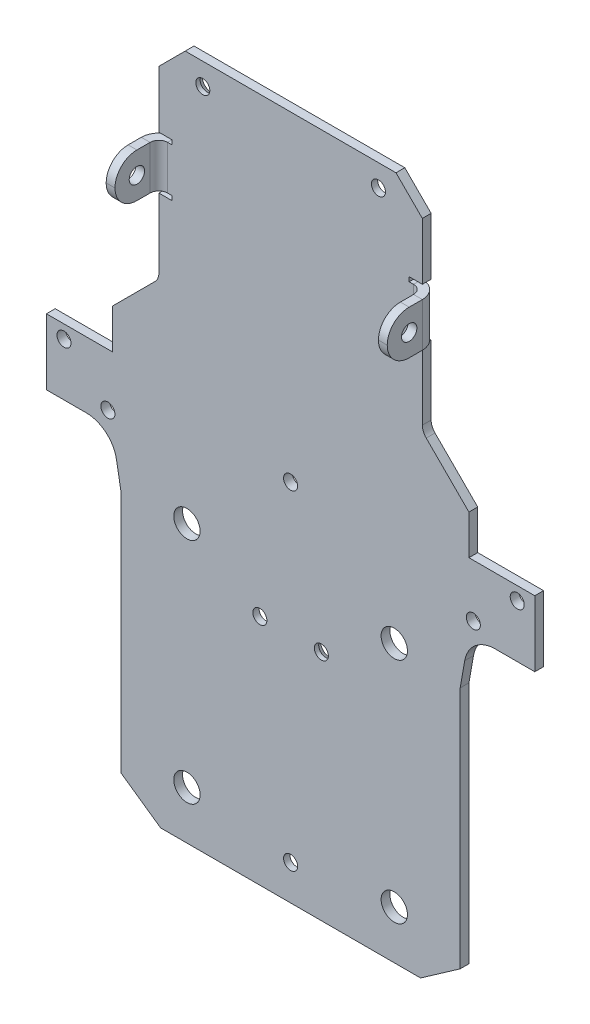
ISO-10303-21;
HEADER;
FILE_DESCRIPTION(('STEP AP214'),'2;1');
FILE_NAME('part.step','',(''),(''),'','','');
FILE_SCHEMA(('AUTOMOTIVE_DESIGN { 1 0 10303 214 1 1 1 1 }'));
ENDSEC;
DATA;
#1=APPLICATION_CONTEXT('core data for automotive mechanical design processes');
#2=APPLICATION_PROTOCOL_DEFINITION('international standard','automotive_design',2000,#1);
#3=PRODUCT_CONTEXT('',#1,'mechanical');
#4=PRODUCT('Part','Part','',(#3));
#5=PRODUCT_RELATED_PRODUCT_CATEGORY('part','',(#4));
#6=PRODUCT_DEFINITION_FORMATION('','',#4);
#7=PRODUCT_DEFINITION_CONTEXT('part definition',#1,'design');
#8=PRODUCT_DEFINITION('design','',#6,#7);
#9=PRODUCT_DEFINITION_SHAPE('','',#8);
#10=(LENGTH_UNIT() NAMED_UNIT(*) SI_UNIT(.MILLI.,.METRE.));
#11=(NAMED_UNIT(*) PLANE_ANGLE_UNIT() SI_UNIT($,.RADIAN.));
#12=(NAMED_UNIT(*) SI_UNIT($,.STERADIAN.) SOLID_ANGLE_UNIT());
#13=UNCERTAINTY_MEASURE_WITH_UNIT(LENGTH_MEASURE(1.E-05),#10,'distance_accuracy_value','');
#14=(GEOMETRIC_REPRESENTATION_CONTEXT(3) GLOBAL_UNCERTAINTY_ASSIGNED_CONTEXT((#13)) GLOBAL_UNIT_ASSIGNED_CONTEXT((#10,
#11,#12)) REPRESENTATION_CONTEXT('',''));
#15=CARTESIAN_POINT('',(0.,0.,0.));
#16=DIRECTION('',(0.,0.,1.));
#17=DIRECTION('',(1.,0.,0.));
#18=AXIS2_PLACEMENT_3D('',#15,#16,#17);
#19=CARTESIAN_POINT('',(-55.6066017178,130.999999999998,7.00000000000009));
#20=DIRECTION('',(1.,0.,0.));
#21=DIRECTION('',(0.,1.,0.));
#22=AXIS2_PLACEMENT_3D('',#19,#20,#21);
#23=CYLINDRICAL_SURFACE('',#22,1.75);
#24=CARTESIAN_POINT('',(31.9999999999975,131.,7.00000000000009));
#25=DIRECTION('',(-1.,0.,0.));
#26=DIRECTION('',(0.,-1.,0.));
#27=AXIS2_PLACEMENT_3D('',#24,#25,#26);
#28=CIRCLE('',#27,1.75);
#29=CARTESIAN_POINT('',(31.9999999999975,132.75,7.00000000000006));
#30=VERTEX_POINT('',#29);
#31=EDGE_CURVE('E597',#30,#30,#28,.T.);
#32=CARTESIAN_POINT('',(29.9999999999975,131.,7.00000000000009));
#33=DIRECTION('',(1.,0.,0.));
#34=DIRECTION('',(0.,1.,0.));
#35=AXIS2_PLACEMENT_3D('',#32,#33,#34);
#36=CIRCLE('',#35,1.75);
#37=CARTESIAN_POINT('',(29.9999999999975,132.75,7.00000000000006));
#38=VERTEX_POINT('',#37);
#39=EDGE_CURVE('E617',#38,#38,#36,.F.);
#40=CARTESIAN_POINT('',(31.9999999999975,132.75,7.00000000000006));
#41=CARTESIAN_POINT('',(31.9791666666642,132.75,7.00000000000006));
#42=CARTESIAN_POINT('',(31.9583333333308,132.75,7.00000000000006));
#43=CARTESIAN_POINT('',(31.9166666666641,132.75,7.00000000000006));
#44=CARTESIAN_POINT('',(31.8958333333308,132.75,7.00000000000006));
#45=CARTESIAN_POINT('',(31.8541666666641,132.75,7.00000000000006));
#46=CARTESIAN_POINT('',(31.8333333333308,132.75,7.00000000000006));
#47=CARTESIAN_POINT('',(31.7916666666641,132.75,7.00000000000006));
#48=CARTESIAN_POINT('',(31.7708333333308,132.75,7.00000000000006));
#49=CARTESIAN_POINT('',(31.7291666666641,132.75,7.00000000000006));
#50=CARTESIAN_POINT('',(31.7083333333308,132.75,7.00000000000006));
#51=CARTESIAN_POINT('',(31.6666666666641,132.75,7.00000000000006));
#52=CARTESIAN_POINT('',(31.6458333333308,132.75,7.00000000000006));
#53=CARTESIAN_POINT('',(31.6041666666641,132.75,7.00000000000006));
#54=CARTESIAN_POINT('',(31.5833333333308,132.75,7.00000000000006));
#55=CARTESIAN_POINT('',(31.5416666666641,132.75,7.00000000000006));
#56=CARTESIAN_POINT('',(31.5208333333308,132.75,7.00000000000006));
#57=CARTESIAN_POINT('',(31.4791666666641,132.75,7.00000000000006));
#58=CARTESIAN_POINT('',(31.4583333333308,132.75,7.00000000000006));
#59=CARTESIAN_POINT('',(31.4166666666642,132.75,7.00000000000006));
#60=CARTESIAN_POINT('',(31.3958333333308,132.75,7.00000000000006));
#61=CARTESIAN_POINT('',(31.3541666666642,132.75,7.00000000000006));
#62=CARTESIAN_POINT('',(31.3333333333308,132.75,7.00000000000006));
#63=CARTESIAN_POINT('',(31.2916666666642,132.75,7.00000000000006));
#64=CARTESIAN_POINT('',(31.2708333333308,132.75,7.00000000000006));
#65=CARTESIAN_POINT('',(31.2291666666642,132.75,7.00000000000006));
#66=CARTESIAN_POINT('',(31.2083333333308,132.75,7.00000000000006));
#67=CARTESIAN_POINT('',(31.1666666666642,132.75,7.00000000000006));
#68=CARTESIAN_POINT('',(31.1458333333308,132.75,7.00000000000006));
#69=CARTESIAN_POINT('',(31.1041666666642,132.75,7.00000000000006));
#70=CARTESIAN_POINT('',(31.0833333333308,132.75,7.00000000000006));
#71=CARTESIAN_POINT('',(31.0416666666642,132.75,7.00000000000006));
#72=CARTESIAN_POINT('',(31.0208333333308,132.75,7.00000000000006));
#73=CARTESIAN_POINT('',(30.9791666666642,132.75,7.00000000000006));
#74=CARTESIAN_POINT('',(30.9583333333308,132.75,7.00000000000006));
#75=CARTESIAN_POINT('',(30.9166666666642,132.75,7.00000000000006));
#76=CARTESIAN_POINT('',(30.8958333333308,132.75,7.00000000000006));
#77=CARTESIAN_POINT('',(30.8541666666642,132.75,7.00000000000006));
#78=CARTESIAN_POINT('',(30.8333333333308,132.75,7.00000000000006));
#79=CARTESIAN_POINT('',(30.7916666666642,132.75,7.00000000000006));
#80=CARTESIAN_POINT('',(30.7708333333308,132.75,7.00000000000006));
#81=CARTESIAN_POINT('',(30.7291666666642,132.75,7.00000000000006));
#82=CARTESIAN_POINT('',(30.7083333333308,132.75,7.00000000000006));
#83=CARTESIAN_POINT('',(30.6666666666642,132.75,7.00000000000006));
#84=CARTESIAN_POINT('',(30.6458333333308,132.75,7.00000000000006));
#85=CARTESIAN_POINT('',(30.6041666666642,132.75,7.00000000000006));
#86=CARTESIAN_POINT('',(30.5833333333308,132.75,7.00000000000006));
#87=CARTESIAN_POINT('',(30.5416666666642,132.75,7.00000000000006));
#88=CARTESIAN_POINT('',(30.5208333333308,132.75,7.00000000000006));
#89=CARTESIAN_POINT('',(30.4791666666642,132.75,7.00000000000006));
#90=CARTESIAN_POINT('',(30.4583333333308,132.75,7.00000000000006));
#91=CARTESIAN_POINT('',(30.4166666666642,132.75,7.00000000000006));
#92=CARTESIAN_POINT('',(30.3958333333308,132.75,7.00000000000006));
#93=CARTESIAN_POINT('',(30.3541666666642,132.75,7.00000000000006));
#94=CARTESIAN_POINT('',(30.3333333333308,132.75,7.00000000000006));
#95=CARTESIAN_POINT('',(30.2916666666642,132.75,7.00000000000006));
#96=CARTESIAN_POINT('',(30.2708333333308,132.75,7.00000000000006));
#97=CARTESIAN_POINT('',(30.2291666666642,132.75,7.00000000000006));
#98=CARTESIAN_POINT('',(30.2083333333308,132.75,7.00000000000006));
#99=CARTESIAN_POINT('',(30.1666666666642,132.75,7.00000000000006));
#100=CARTESIAN_POINT('',(30.1458333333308,132.75,7.00000000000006));
#101=CARTESIAN_POINT('',(30.1041666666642,132.75,7.00000000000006));
#102=CARTESIAN_POINT('',(30.0833333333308,132.75,7.00000000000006));
#103=CARTESIAN_POINT('',(30.0416666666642,132.75,7.00000000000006));
#104=CARTESIAN_POINT('',(30.0208333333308,132.75,7.00000000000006));
#105=CARTESIAN_POINT('',(29.9999999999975,132.75,7.00000000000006));
#106=B_SPLINE_CURVE_WITH_KNOTS('',3,(#40,#41,#42,#43,#44,#45,#46,#47,#48,#49,#50,#51,#52,#53,
#54,#55,#56,#57,#58,#59,#60,#61,#62,#63,#64,#65,#66,#67,#68,#69,#70,#71,#72,#73,#74,#75,#76,#77,
#78,#79,#80,#81,#82,#83,#84,#85,#86,#87,#88,#89,#90,#91,#92,#93,#94,#95,#96,#97,#98,#99,#100,
#101,#102,#103,#104,#105),.UNSPECIFIED.,.F.,.F.,(4,2,2,2,2,2,2,2,2,2,2,2,2,2,2,2,2,2,2,2,2,2,2,
2,2,2,2,2,2,2,2,2,4),(0.,0.0624999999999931,0.125,0.187499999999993,0.25,0.312499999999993,
0.375,0.437499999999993,0.5,0.562499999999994,0.624999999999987,0.687499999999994,
0.749999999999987,0.812499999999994,0.874999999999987,0.937499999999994,0.999999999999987,
1.06249999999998,1.12499999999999,1.18749999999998,1.24999999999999,1.31249999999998,
1.37499999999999,1.43749999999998,1.49999999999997,1.56249999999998,1.62499999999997,
1.68749999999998,1.74999999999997,1.81249999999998,1.87499999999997,1.93749999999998,
1.99999999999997),.UNSPECIFIED.);
#107=EDGE_CURVE('BSEAM27',#30,#38,#106,.T.);
#108=ORIENTED_EDGE('',*,*,#31,.F.);
#109=ORIENTED_EDGE('',*,*,#39,.T.);
#110=ORIENTED_EDGE('',*,*,#107,.T.);
#111=ORIENTED_EDGE('',*,*,#107,.F.);
#112=EDGE_LOOP('',(#108,#110,#109,#111));
#113=FACE_BOUND('',#112,.T.);
#114=ADVANCED_FACE('F27',(#113),#23,.F.);
#115=CARTESIAN_POINT('',(4.38750305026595,130.999999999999,7.0000000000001));
#116=DIRECTION('',(1.,0.,0.));
#117=DIRECTION('',(0.,0.,-1.));
#118=AXIS2_PLACEMENT_3D('',#115,#116,#117);
#119=CYLINDRICAL_SURFACE('',#118,5.);
#120=CARTESIAN_POINT('',(31.9999999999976,131.,7.00000000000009));
#121=DIRECTION('',(1.,0.,0.));
#122=DIRECTION('',(0.,1.,0.));
#123=AXIS2_PLACEMENT_3D('',#120,#121,#122);
#124=CIRCLE('',#123,5.);
#125=CARTESIAN_POINT('',(31.9999999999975,136.,6.99999999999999));
#126=VERTEX_POINT('',#125);
#127=CARTESIAN_POINT('',(31.9999999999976,131.,12.0000000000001));
#128=VERTEX_POINT('',#127);
#129=EDGE_CURVE('E603',#126,#128,#124,.T.);
#130=ORIENTED_EDGE('',*,*,#129,.F.);
#131=DIRECTION('',(1.,0.,0.));
#132=VECTOR('',#131,1.);
#133=CARTESIAN_POINT('',(4.38750305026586,135.999999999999,6.99999999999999));
#134=LINE('',#133,#132);
#135=CARTESIAN_POINT('',(29.9999999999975,136.,6.99999999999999));
#136=VERTEX_POINT('',#135);
#137=EDGE_CURVE('E593',#136,#126,#134,.T.);
#138=ORIENTED_EDGE('',*,*,#137,.F.);
#139=CARTESIAN_POINT('',(29.9999999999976,131.,7.00000000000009));
#140=DIRECTION('',(1.,0.,0.));
#141=DIRECTION('',(0.,1.,0.));
#142=AXIS2_PLACEMENT_3D('',#139,#140,#141);
#143=CIRCLE('',#142,5.);
#144=CARTESIAN_POINT('',(29.9999999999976,131.,12.0000000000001));
#145=VERTEX_POINT('',#144);
#146=EDGE_CURVE('E44',#145,#136,#143,.F.);
#147=ORIENTED_EDGE('',*,*,#146,.F.);
#148=DIRECTION('',(1.,0.,0.));
#149=VECTOR('',#148,1.);
#150=CARTESIAN_POINT('',(4.38750305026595,130.999999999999,12.0000000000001));
#151=LINE('',#150,#149);
#152=EDGE_CURVE('E614',#145,#128,#151,.T.);
#153=ORIENTED_EDGE('',*,*,#152,.T.);
#154=EDGE_LOOP('',(#130,#138,#147,#153));
#155=FACE_BOUND('',#154,.T.);
#156=ADVANCED_FACE('F935',(#155),#119,.T.);
#157=CARTESIAN_POINT('',(4.38750305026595,130.999999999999,7.0000000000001));
#158=DIRECTION('',(1.,0.,0.));
#159=DIRECTION('',(0.,0.,-1.));
#160=AXIS2_PLACEMENT_3D('',#157,#158,#159);
#161=CYLINDRICAL_SURFACE('',#160,5.);
#162=CARTESIAN_POINT('',(31.9999999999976,131.,7.00000000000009));
#163=DIRECTION('',(1.,0.,0.));
#164=DIRECTION('',(0.,1.,0.));
#165=AXIS2_PLACEMENT_3D('',#162,#163,#164);
#166=CIRCLE('',#165,5.);
#167=CARTESIAN_POINT('',(31.9999999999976,126.,7.00000000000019));
#168=VERTEX_POINT('',#167);
#169=EDGE_CURVE('E600',#128,#168,#166,.T.);
#170=ORIENTED_EDGE('',*,*,#169,.F.);
#171=ORIENTED_EDGE('',*,*,#152,.F.);
#172=CARTESIAN_POINT('',(29.9999999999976,131.,7.00000000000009));
#173=DIRECTION('',(1.,0.,0.));
#174=DIRECTION('',(0.,1.,0.));
#175=AXIS2_PLACEMENT_3D('',#172,#173,#174);
#176=CIRCLE('',#175,5.);
#177=CARTESIAN_POINT('',(29.9999999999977,126.,7.00000000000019));
#178=VERTEX_POINT('',#177);
#179=EDGE_CURVE('E587',#178,#145,#176,.F.);
#180=ORIENTED_EDGE('',*,*,#179,.F.);
#181=DIRECTION('',(1.,0.,0.));
#182=VECTOR('',#181,1.);
#183=CARTESIAN_POINT('',(4.38750305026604,125.999999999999,7.00000000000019));
#184=LINE('',#183,#182);
#185=EDGE_CURVE('E611',#178,#168,#184,.T.);
#186=ORIENTED_EDGE('',*,*,#185,.T.);
#187=EDGE_LOOP('',(#170,#171,#180,#186));
#188=FACE_BOUND('',#187,.T.);
#189=ADVANCED_FACE('F941',(#188),#161,.T.);
#190=CARTESIAN_POINT('',(4.38750305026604,125.999999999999,1.83880688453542E-13));
#191=DIRECTION('',(0.,1.,0.));
#192=DIRECTION('',(0.,0.,-1.));
#193=AXIS2_PLACEMENT_3D('',#190,#191,#192);
#194=PLANE('',#193);
#195=DIRECTION('',(0.,0.,1.));
#196=VECTOR('',#195,1.);
#197=CARTESIAN_POINT('',(31.9999999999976,125.999999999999,1.83880688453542E-13));
#198=LINE('',#197,#196);
#199=CARTESIAN_POINT('',(32.0000000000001,126.,4.00000000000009));
#200=VERTEX_POINT('',#199);
#201=EDGE_CURVE('E609',#200,#168,#198,.T.);
#202=ORIENTED_EDGE('',*,*,#201,.T.);
#203=ORIENTED_EDGE('',*,*,#185,.F.);
#204=DIRECTION('',(0.,0.,1.));
#205=VECTOR('',#204,1.);
#206=CARTESIAN_POINT('',(29.9999999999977,125.999999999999,1.83880688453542E-13));
#207=LINE('',#206,#205);
#208=CARTESIAN_POINT('',(29.9999999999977,126.,4.00000000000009));
#209=VERTEX_POINT('',#208);
#210=EDGE_CURVE('E589',#209,#178,#207,.T.);
#211=ORIENTED_EDGE('',*,*,#210,.F.);
#212=DIRECTION('',(1.,0.,0.));
#213=VECTOR('',#212,1.);
#214=CARTESIAN_POINT('',(4.38750305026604,125.999999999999,4.00000000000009));
#215=LINE('',#214,#213);
#216=EDGE_CURVE('E606',#209,#200,#215,.T.);
#217=ORIENTED_EDGE('',*,*,#216,.T.);
#218=EDGE_LOOP('',(#202,#203,#211,#217));
#219=FACE_BOUND('',#218,.T.);
#220=ADVANCED_FACE('F951',(#219),#194,.F.);
#221=CARTESIAN_POINT('',(31.9999999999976,125.999999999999,1.83880688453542E-13));
#222=DIRECTION('',(1.,0.,0.));
#223=DIRECTION('',(0.,-1.,0.));
#224=AXIS2_PLACEMENT_3D('',#221,#222,#223);
#225=PLANE('',#224);
#226=DIRECTION('',(0.,-1.,0.));
#227=VECTOR('',#226,1.);
#228=CARTESIAN_POINT('',(31.9999999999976,126.,4.00000000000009));
#229=LINE('',#228,#227);
#230=CARTESIAN_POINT('',(31.9999999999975,136.,4.));
#231=VERTEX_POINT('',#230);
#232=EDGE_CURVE('E620',#231,#200,#229,.T.);
#233=ORIENTED_EDGE('',*,*,#232,.F.);
#234=DIRECTION('',(0.,0.,-1.));
#235=VECTOR('',#234,1.);
#236=CARTESIAN_POINT('',(31.9999999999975,136.,12.));
#237=LINE('',#236,#235);
#238=EDGE_CURVE('E595',#126,#231,#237,.T.);
#239=ORIENTED_EDGE('',*,*,#238,.F.);
#240=ORIENTED_EDGE('',*,*,#129,.T.);
#241=ORIENTED_EDGE('',*,*,#169,.T.);
#242=ORIENTED_EDGE('',*,*,#201,.F.);
#243=EDGE_LOOP('',(#233,#239,#240,#241,#242));
#244=FACE_BOUND('',#243,.T.);
#245=ORIENTED_EDGE('',*,*,#31,.T.);
#246=EDGE_LOOP('',(#245));
#247=FACE_BOUND('',#246,.T.);
#248=ADVANCED_FACE('F955',(#244,#247),#225,.T.);
#249=CARTESIAN_POINT('',(4.38750305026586,135.999999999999,12.));
#250=DIRECTION('',(0.,-1.,0.));
#251=DIRECTION('',(0.,0.,1.));
#252=AXIS2_PLACEMENT_3D('',#249,#250,#251);
#253=PLANE('',#252);
#254=ORIENTED_EDGE('',*,*,#238,.T.);
#255=DIRECTION('',(1.,0.,0.));
#256=VECTOR('',#255,1.);
#257=CARTESIAN_POINT('',(4.38750305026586,135.999999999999,4.));
#258=LINE('',#257,#256);
#259=CARTESIAN_POINT('',(29.9999999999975,136.,4.));
#260=VERTEX_POINT('',#259);
#261=EDGE_CURVE('E548',#260,#231,#258,.T.);
#262=ORIENTED_EDGE('',*,*,#261,.F.);
#263=DIRECTION('',(0.,0.,-1.));
#264=VECTOR('',#263,1.);
#265=CARTESIAN_POINT('',(29.9999999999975,136.,12.));
#266=LINE('',#265,#264);
#267=EDGE_CURVE('E67',#136,#260,#266,.T.);
#268=ORIENTED_EDGE('',*,*,#267,.F.);
#269=ORIENTED_EDGE('',*,*,#137,.T.);
#270=EDGE_LOOP('',(#254,#262,#268,#269));
#271=FACE_BOUND('',#270,.T.);
#272=ADVANCED_FACE('F958',(#271),#253,.F.);
#273=CARTESIAN_POINT('',(29.9999999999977,125.999999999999,1.83880688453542E-13));
#274=DIRECTION('',(1.,0.,0.));
#275=DIRECTION('',(0.,-1.,0.));
#276=AXIS2_PLACEMENT_3D('',#273,#274,#275);
#277=PLANE('',#276);
#278=ORIENTED_EDGE('',*,*,#267,.T.);
#279=DIRECTION('',(0.,-1.,0.));
#280=VECTOR('',#279,1.);
#281=CARTESIAN_POINT('',(29.9999999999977,126.,4.00000000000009));
#282=LINE('',#281,#280);
#283=EDGE_CURVE('E71',#260,#209,#282,.T.);
#284=ORIENTED_EDGE('',*,*,#283,.T.);
#285=ORIENTED_EDGE('',*,*,#210,.T.);
#286=ORIENTED_EDGE('',*,*,#179,.T.);
#287=ORIENTED_EDGE('',*,*,#146,.T.);
#288=EDGE_LOOP('',(#278,#284,#285,#286,#287));
#289=FACE_BOUND('',#288,.T.);
#290=ORIENTED_EDGE('',*,*,#39,.F.);
#291=EDGE_LOOP('',(#290));
#292=FACE_BOUND('',#291,.T.);
#293=ADVANCED_FACE('F29',(#289,#292),#277,.F.);
#294=CARTESIAN_POINT('',(2.45636844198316E-12,131.,6.99999999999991));
#295=DIRECTION('',(-1.,0.,0.));
#296=DIRECTION('',(0.,-1.,0.));
#297=AXIS2_PLACEMENT_3D('',#294,#295,#296);
#298=CYLINDRICAL_SURFACE('',#297,1.75);
#299=CARTESIAN_POINT('',(-31.9999999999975,131.,6.9999999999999));
#300=DIRECTION('',(-1.,0.,0.));
#301=DIRECTION('',(0.,-1.,0.));
#302=AXIS2_PLACEMENT_3D('',#299,#300,#301);
#303=CIRCLE('',#302,1.75);
#304=CARTESIAN_POINT('',(-31.9999999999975,129.25,6.99999999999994));
#305=VERTEX_POINT('',#304);
#306=EDGE_CURVE('E578',#305,#305,#303,.T.);
#307=ORIENTED_EDGE('',*,*,#306,.T.);
#308=EDGE_LOOP('',(#307));
#309=FACE_BOUND('',#308,.T.);
#310=CARTESIAN_POINT('',(-29.9999999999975,131.,6.9999999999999));
#311=DIRECTION('',(-1.,0.,0.));
#312=DIRECTION('',(0.,-1.,0.));
#313=AXIS2_PLACEMENT_3D('',#310,#311,#312);
#314=CIRCLE('',#313,1.75);
#315=CARTESIAN_POINT('',(-29.9999999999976,129.25,6.99999999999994));
#316=VERTEX_POINT('',#315);
#317=EDGE_CURVE('E555',#316,#316,#314,.T.);
#318=ORIENTED_EDGE('',*,*,#317,.F.);
#319=EDGE_LOOP('',(#318));
#320=FACE_BOUND('',#319,.T.);
#321=ADVANCED_FACE('F965',(#309,#320),#298,.F.);
#322=CARTESIAN_POINT('',(-4.38750305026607,130.999999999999,6.99999999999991));
#323=DIRECTION('',(-1.,0.,0.));
#324=DIRECTION('',(0.,0.,1.));
#325=AXIS2_PLACEMENT_3D('',#322,#323,#324);
#326=CYLINDRICAL_SURFACE('',#325,5.);
#327=CARTESIAN_POINT('',(-31.9999999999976,131.,6.9999999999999));
#328=DIRECTION('',(-1.,0.,0.));
#329=DIRECTION('',(0.,-1.,0.));
#330=AXIS2_PLACEMENT_3D('',#327,#328,#329);
#331=CIRCLE('',#330,5.);
#332=CARTESIAN_POINT('',(-31.9999999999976,126.,7.));
#333=VERTEX_POINT('',#332);
#334=CARTESIAN_POINT('',(-31.9999999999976,131.,11.9999999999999));
#335=VERTEX_POINT('',#334);
#336=EDGE_CURVE('E567',#333,#335,#331,.T.);
#337=ORIENTED_EDGE('',*,*,#336,.F.);
#338=DIRECTION('',(-1.,0.,0.));
#339=VECTOR('',#338,1.);
#340=CARTESIAN_POINT('',(-4.38750305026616,125.999999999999,7.));
#341=LINE('',#340,#339);
#342=CARTESIAN_POINT('',(-29.9999999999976,126.,7.));
#343=VERTEX_POINT('',#342);
#344=EDGE_CURVE('E560',#343,#333,#341,.T.);
#345=ORIENTED_EDGE('',*,*,#344,.F.);
#346=CARTESIAN_POINT('',(-29.9999999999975,131.,6.9999999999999));
#347=DIRECTION('',(-1.,0.,0.));
#348=DIRECTION('',(0.,-1.,0.));
#349=AXIS2_PLACEMENT_3D('',#346,#347,#348);
#350=CIRCLE('',#349,5.);
#351=CARTESIAN_POINT('',(-29.9999999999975,131.,11.9999999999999));
#352=VERTEX_POINT('',#351);
#353=EDGE_CURVE('E545',#352,#343,#350,.F.);
#354=ORIENTED_EDGE('',*,*,#353,.F.);
#355=DIRECTION('',(-1.,0.,0.));
#356=VECTOR('',#355,1.);
#357=CARTESIAN_POINT('',(-4.38750305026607,130.999999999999,11.9999999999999));
#358=LINE('',#357,#356);
#359=EDGE_CURVE('E575',#352,#335,#358,.T.);
#360=ORIENTED_EDGE('',*,*,#359,.T.);
#361=EDGE_LOOP('',(#337,#345,#354,#360));
#362=FACE_BOUND('',#361,.T.);
#363=ADVANCED_FACE('F1638',(#362),#326,.T.);
#364=CARTESIAN_POINT('',(-4.38750305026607,130.999999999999,6.99999999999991));
#365=DIRECTION('',(-1.,0.,0.));
#366=DIRECTION('',(0.,0.,1.));
#367=AXIS2_PLACEMENT_3D('',#364,#365,#366);
#368=CYLINDRICAL_SURFACE('',#367,5.);
#369=CARTESIAN_POINT('',(-31.9999999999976,131.,6.9999999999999));
#370=DIRECTION('',(-1.,0.,0.));
#371=DIRECTION('',(0.,-1.,0.));
#372=AXIS2_PLACEMENT_3D('',#369,#370,#371);
#373=CIRCLE('',#372,5.);
#374=CARTESIAN_POINT('',(-31.9999999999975,136.,6.99999999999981));
#375=VERTEX_POINT('',#374);
#376=EDGE_CURVE('E565',#335,#375,#373,.T.);
#377=ORIENTED_EDGE('',*,*,#376,.F.);
#378=ORIENTED_EDGE('',*,*,#359,.F.);
#379=CARTESIAN_POINT('',(-29.9999999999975,131.,6.9999999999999));
#380=DIRECTION('',(-1.,0.,0.));
#381=DIRECTION('',(0.,-1.,0.));
#382=AXIS2_PLACEMENT_3D('',#379,#380,#381);
#383=CIRCLE('',#382,5.);
#384=CARTESIAN_POINT('',(-29.9999999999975,136.,6.99999999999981));
#385=VERTEX_POINT('',#384);
#386=EDGE_CURVE('E549',#385,#352,#383,.F.);
#387=ORIENTED_EDGE('',*,*,#386,.F.);
#388=DIRECTION('',(-1.,0.,0.));
#389=VECTOR('',#388,1.);
#390=CARTESIAN_POINT('',(-4.38750305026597,135.999999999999,6.99999999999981));
#391=LINE('',#390,#389);
#392=EDGE_CURVE('E572',#385,#375,#391,.T.);
#393=ORIENTED_EDGE('',*,*,#392,.T.);
#394=EDGE_LOOP('',(#377,#378,#387,#393));
#395=FACE_BOUND('',#394,.T.);
#396=ADVANCED_FACE('F1628',(#395),#368,.T.);
#397=CARTESIAN_POINT('',(-4.38750305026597,135.999999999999,11.9999999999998));
#398=DIRECTION('',(0.,1.,0.));
#399=DIRECTION('',(0.,0.,1.));
#400=AXIS2_PLACEMENT_3D('',#397,#398,#399);
#401=PLANE('',#400);
#402=DIRECTION('',(-1.,0.,0.));
#403=VECTOR('',#402,1.);
#404=CARTESIAN_POINT('',(-4.38750305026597,135.999999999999,3.99999999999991));
#405=LINE('',#404,#403);
#406=CARTESIAN_POINT('',(-29.9999999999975,136.,3.99999999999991));
#407=VERTEX_POINT('',#406);
#408=CARTESIAN_POINT('',(-31.9999999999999,136.,3.99999999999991));
#409=VERTEX_POINT('',#408);
#410=EDGE_CURVE('E570',#407,#409,#405,.T.);
#411=ORIENTED_EDGE('',*,*,#410,.T.);
#412=DIRECTION('',(0.,0.,-1.));
#413=VECTOR('',#412,1.);
#414=CARTESIAN_POINT('',(-31.9999999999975,136.,11.9999999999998));
#415=LINE('',#414,#413);
#416=EDGE_CURVE('E562',#375,#409,#415,.T.);
#417=ORIENTED_EDGE('',*,*,#416,.F.);
#418=ORIENTED_EDGE('',*,*,#392,.F.);
#419=DIRECTION('',(0.,0.,-1.));
#420=VECTOR('',#419,1.);
#421=CARTESIAN_POINT('',(-29.9999999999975,136.,11.9999999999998));
#422=LINE('',#421,#420);
#423=EDGE_CURVE('E111',#385,#407,#422,.T.);
#424=ORIENTED_EDGE('',*,*,#423,.T.);
#425=EDGE_LOOP('',(#411,#417,#418,#424));
#426=FACE_BOUND('',#425,.T.);
#427=ADVANCED_FACE('F1620',(#426),#401,.T.);
#428=CARTESIAN_POINT('',(-31.9999999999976,125.999999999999,0.));
#429=DIRECTION('',(-1.,0.,0.));
#430=DIRECTION('',(0.,-1.,0.));
#431=AXIS2_PLACEMENT_3D('',#428,#429,#430);
#432=PLANE('',#431);
#433=DIRECTION('',(0.,1.,0.));
#434=VECTOR('',#433,1.);
#435=CARTESIAN_POINT('',(-31.9999999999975,136.,3.99999999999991));
#436=LINE('',#435,#434);
#437=CARTESIAN_POINT('',(-31.9999999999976,126.,4.));
#438=VERTEX_POINT('',#437);
#439=EDGE_CURVE('E581',#438,#409,#436,.T.);
#440=ORIENTED_EDGE('',*,*,#439,.F.);
#441=DIRECTION('',(0.,0.,-1.));
#442=VECTOR('',#441,1.);
#443=CARTESIAN_POINT('',(-31.9999999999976,125.999999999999,0.));
#444=LINE('',#443,#442);
#445=EDGE_CURVE('E558',#333,#438,#444,.T.);
#446=ORIENTED_EDGE('',*,*,#445,.F.);
#447=ORIENTED_EDGE('',*,*,#336,.T.);
#448=ORIENTED_EDGE('',*,*,#376,.T.);
#449=ORIENTED_EDGE('',*,*,#416,.T.);
#450=EDGE_LOOP('',(#440,#446,#447,#448,#449));
#451=FACE_BOUND('',#450,.T.);
#452=ORIENTED_EDGE('',*,*,#306,.F.);
#453=EDGE_LOOP('',(#452));
#454=FACE_BOUND('',#453,.T.);
#455=ADVANCED_FACE('F1611',(#451,#454),#432,.T.);
#456=CARTESIAN_POINT('',(-4.38750305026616,125.999999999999,0.));
#457=DIRECTION('',(0.,-1.,0.));
#458=DIRECTION('',(0.,0.,-1.));
#459=AXIS2_PLACEMENT_3D('',#456,#457,#458);
#460=PLANE('',#459);
#461=ORIENTED_EDGE('',*,*,#344,.T.);
#462=ORIENTED_EDGE('',*,*,#445,.T.);
#463=DIRECTION('',(-1.,0.,0.));
#464=VECTOR('',#463,1.);
#465=CARTESIAN_POINT('',(-4.38750305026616,125.999999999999,4.));
#466=LINE('',#465,#464);
#467=CARTESIAN_POINT('',(-29.9999999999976,126.,4.));
#468=VERTEX_POINT('',#467);
#469=EDGE_CURVE('E105',#468,#438,#466,.T.);
#470=ORIENTED_EDGE('',*,*,#469,.F.);
#471=DIRECTION('',(0.,0.,-1.));
#472=VECTOR('',#471,1.);
#473=CARTESIAN_POINT('',(-29.9999999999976,125.999999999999,0.));
#474=LINE('',#473,#472);
#475=EDGE_CURVE('E80',#343,#468,#474,.T.);
#476=ORIENTED_EDGE('',*,*,#475,.F.);
#477=EDGE_LOOP('',(#461,#462,#470,#476));
#478=FACE_BOUND('',#477,.T.);
#479=ADVANCED_FACE('F1604',(#478),#460,.T.);
#480=CARTESIAN_POINT('',(-29.9999999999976,125.999999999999,0.));
#481=DIRECTION('',(-1.,0.,0.));
#482=DIRECTION('',(0.,-1.,0.));
#483=AXIS2_PLACEMENT_3D('',#480,#481,#482);
#484=PLANE('',#483);
#485=ORIENTED_EDGE('',*,*,#317,.T.);
#486=EDGE_LOOP('',(#485));
#487=FACE_BOUND('',#486,.T.);
#488=ORIENTED_EDGE('',*,*,#475,.T.);
#489=DIRECTION('',(0.,1.,0.));
#490=VECTOR('',#489,1.);
#491=CARTESIAN_POINT('',(-29.9999999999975,136.,3.99999999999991));
#492=LINE('',#491,#490);
#493=EDGE_CURVE('E552',#468,#407,#492,.T.);
#494=ORIENTED_EDGE('',*,*,#493,.T.);
#495=ORIENTED_EDGE('',*,*,#423,.F.);
#496=ORIENTED_EDGE('',*,*,#386,.T.);
#497=ORIENTED_EDGE('',*,*,#353,.T.);
#498=EDGE_LOOP('',(#488,#494,#495,#496,#497));
#499=FACE_BOUND('',#498,.T.);
#500=ADVANCED_FACE('F663',(#487,#499),#484,.F.);
#501=CARTESIAN_POINT('',(-46.5421450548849,66.3933982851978,0.));
#502=DIRECTION('',(0.,0.,1.));
#503=DIRECTION('',(1.,0.,0.));
#504=AXIS2_PLACEMENT_3D('',#501,#502,#503);
#505=PLANE('',#504);
#506=CARTESIAN_POINT('',(0.,8.00000000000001,0.));
#507=DIRECTION('',(0.,0.,1.));
#508=DIRECTION('',(1.,0.,0.));
#509=AXIS2_PLACEMENT_3D('',#506,#507,#508);
#510=CIRCLE('',#509,2.59999999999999);
#511=CARTESIAN_POINT('',(2.59999999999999,8.00000000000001,0.));
#512=VERTEX_POINT('',#511);
#513=EDGE_CURVE('E635',#512,#512,#510,.T.);
#514=ORIENTED_EDGE('',*,*,#513,.T.);
#515=EDGE_LOOP('',(#514));
#516=FACE_BOUND('',#515,.T.);
#517=CARTESIAN_POINT('',(-7.,53.,0.));
#518=DIRECTION('',(0.,0.,1.));
#519=DIRECTION('',(1.,0.,0.));
#520=AXIS2_PLACEMENT_3D('',#517,#518,#519);
#521=CIRCLE('',#520,2.59999999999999);
#522=CARTESIAN_POINT('',(-4.40000000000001,53.,0.));
#523=VERTEX_POINT('',#522);
#524=EDGE_CURVE('E632',#523,#523,#521,.T.);
#525=ORIENTED_EDGE('',*,*,#524,.T.);
#526=EDGE_LOOP('',(#525));
#527=FACE_BOUND('',#526,.T.);
#528=CARTESIAN_POINT('',(7.,53.,0.));
#529=DIRECTION('',(0.,0.,1.));
#530=DIRECTION('',(1.,0.,0.));
#531=AXIS2_PLACEMENT_3D('',#528,#529,#530);
#532=CIRCLE('',#531,2.17735026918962);
#533=CARTESIAN_POINT('',(9.17735026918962,53.,0.));
#534=VERTEX_POINT('',#533);
#535=EDGE_CURVE('E629',#534,#534,#532,.T.);
#536=ORIENTED_EDGE('',*,*,#535,.T.);
#537=EDGE_LOOP('',(#536));
#538=FACE_BOUND('',#537,.T.);
#539=CARTESIAN_POINT('',(-20.,151.,0.));
#540=DIRECTION('',(0.,0.,1.));
#541=DIRECTION('',(1.,0.,0.));
#542=AXIS2_PLACEMENT_3D('',#539,#540,#541);
#543=CIRCLE('',#542,2.17735026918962);
#544=CARTESIAN_POINT('',(-17.8226497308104,151.,0.));
#545=VERTEX_POINT('',#544);
#546=EDGE_CURVE('E626',#545,#545,#543,.T.);
#547=ORIENTED_EDGE('',*,*,#546,.T.);
#548=EDGE_LOOP('',(#547));
#549=FACE_BOUND('',#548,.T.);
#550=CARTESIAN_POINT('',(20.,151.,0.));
#551=DIRECTION('',(0.,0.,1.));
#552=DIRECTION('',(1.,0.,0.));
#553=AXIS2_PLACEMENT_3D('',#550,#551,#552);
#554=CIRCLE('',#553,2.59999999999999);
#555=CARTESIAN_POINT('',(22.6,151.,0.));
#556=VERTEX_POINT('',#555);
#557=EDGE_CURVE('E586',#556,#556,#554,.T.);
#558=ORIENTED_EDGE('',*,*,#557,.T.);
#559=EDGE_LOOP('',(#558));
#560=FACE_BOUND('',#559,.T.);
#561=CARTESIAN_POINT('',(41.6066017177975,76.3933982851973,0.));
#562=DIRECTION('',(0.,0.,-1.));
#563=DIRECTION('',(-1.,0.,0.));
#564=AXIS2_PLACEMENT_3D('',#561,#562,#563);
#565=CIRCLE('',#564,1.6);
#566=CARTESIAN_POINT('',(40.0066017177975,76.3933982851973,0.));
#567=VERTEX_POINT('',#566);
#568=EDGE_CURVE('E671',#567,#567,#565,.T.);
#569=ORIENTED_EDGE('',*,*,#568,.F.);
#570=EDGE_LOOP('',(#569));
#571=FACE_BOUND('',#570,.T.);
#572=CARTESIAN_POINT('',(23.6066017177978,63.,0.));
#573=DIRECTION('',(0.,0.,-1.));
#574=DIRECTION('',(-1.,0.,0.));
#575=AXIS2_PLACEMENT_3D('',#572,#573,#574);
#576=CIRCLE('',#575,3.);
#577=CARTESIAN_POINT('',(20.6066017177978,63.,0.));
#578=VERTEX_POINT('',#577);
#579=EDGE_CURVE('E675',#578,#578,#576,.T.);
#580=ORIENTED_EDGE('',*,*,#579,.F.);
#581=EDGE_LOOP('',(#580));
#582=FACE_BOUND('',#581,.T.);
#583=CARTESIAN_POINT('',(-41.6066017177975,76.3933982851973,0.));
#584=DIRECTION('',(0.,0.,1.));
#585=DIRECTION('',(1.,0.,0.));
#586=AXIS2_PLACEMENT_3D('',#583,#584,#585);
#587=CIRCLE('',#586,1.6);
#588=CARTESIAN_POINT('',(-40.0066017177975,76.3933982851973,0.));
#589=VERTEX_POINT('',#588);
#590=EDGE_CURVE('E679',#589,#589,#587,.T.);
#591=ORIENTED_EDGE('',*,*,#590,.T.);
#592=EDGE_LOOP('',(#591));
#593=FACE_BOUND('',#592,.T.);
#594=CARTESIAN_POINT('',(-51.6066017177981,85.3933982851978,0.));
#595=DIRECTION('',(0.,0.,1.));
#596=DIRECTION('',(1.,0.,0.));
#597=AXIS2_PLACEMENT_3D('',#594,#595,#596);
#598=CIRCLE('',#597,1.6);
#599=CARTESIAN_POINT('',(-50.0066017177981,85.3933982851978,0.));
#600=VERTEX_POINT('',#599);
#601=EDGE_CURVE('E683',#600,#600,#598,.T.);
#602=ORIENTED_EDGE('',*,*,#601,.T.);
#603=EDGE_LOOP('',(#602));
#604=FACE_BOUND('',#603,.T.);
#605=CARTESIAN_POINT('',(-23.6066017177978,11.,0.));
#606=DIRECTION('',(0.,0.,1.));
#607=DIRECTION('',(1.,0.,0.));
#608=AXIS2_PLACEMENT_3D('',#605,#606,#607);
#609=CIRCLE('',#608,3.);
#610=CARTESIAN_POINT('',(-20.6066017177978,11.,0.));
#611=VERTEX_POINT('',#610);
#612=EDGE_CURVE('E687',#611,#611,#609,.T.);
#613=ORIENTED_EDGE('',*,*,#612,.T.);
#614=EDGE_LOOP('',(#613));
#615=FACE_BOUND('',#614,.T.);
#616=CARTESIAN_POINT('',(-23.6066017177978,63.,0.));
#617=DIRECTION('',(0.,0.,1.));
#618=DIRECTION('',(1.,0.,0.));
#619=AXIS2_PLACEMENT_3D('',#616,#617,#618);
#620=CIRCLE('',#619,3.);
#621=CARTESIAN_POINT('',(-20.6066017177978,63.,0.));
#622=VERTEX_POINT('',#621);
#623=EDGE_CURVE('E691',#622,#622,#620,.T.);
#624=ORIENTED_EDGE('',*,*,#623,.T.);
#625=EDGE_LOOP('',(#624));
#626=FACE_BOUND('',#625,.T.);
#627=CARTESIAN_POINT('',(23.6066017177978,11.,0.));
#628=DIRECTION('',(0.,0.,-1.));
#629=DIRECTION('',(-1.,0.,0.));
#630=AXIS2_PLACEMENT_3D('',#627,#628,#629);
#631=CIRCLE('',#630,3.);
#632=CARTESIAN_POINT('',(20.6066017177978,11.,0.));
#633=VERTEX_POINT('',#632);
#634=EDGE_CURVE('E695',#633,#633,#631,.T.);
#635=ORIENTED_EDGE('',*,*,#634,.F.);
#636=EDGE_LOOP('',(#635));
#637=FACE_BOUND('',#636,.T.);
#638=CARTESIAN_POINT('',(51.6066017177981,85.3933982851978,0.));
#639=DIRECTION('',(0.,0.,-1.));
#640=DIRECTION('',(-1.,0.,0.));
#641=AXIS2_PLACEMENT_3D('',#638,#639,#640);
#642=CIRCLE('',#641,1.6);
#643=CARTESIAN_POINT('',(50.0066017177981,85.3933982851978,0.));
#644=VERTEX_POINT('',#643);
#645=EDGE_CURVE('E699',#644,#644,#642,.T.);
#646=ORIENTED_EDGE('',*,*,#645,.F.);
#647=EDGE_LOOP('',(#646));
#648=FACE_BOUND('',#647,.T.);
#649=CARTESIAN_POINT('',(0.,83.,0.));
#650=DIRECTION('',(0.,0.,1.));
#651=DIRECTION('',(1.,0.,0.));
#652=AXIS2_PLACEMENT_3D('',#649,#650,#651);
#653=CIRCLE('',#652,1.6);
#654=CARTESIAN_POINT('',(1.6,83.,0.));
#655=VERTEX_POINT('',#654);
#656=EDGE_CURVE('E703',#655,#655,#653,.T.);
#657=ORIENTED_EDGE('',*,*,#656,.T.);
#658=EDGE_LOOP('',(#657));
#659=FACE_BOUND('',#658,.T.);
#660=DIRECTION('',(0.,1.,0.));
#661=VECTOR('',#660,1.);
#662=CARTESIAN_POINT('',(28.0000000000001,125.999999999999,0.));
#663=LINE('',#662,#661);
#664=CARTESIAN_POINT('',(28.0000000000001,125.999999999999,0.));
#665=VERTEX_POINT('',#664);
#666=CARTESIAN_POINT('',(28.,135.999999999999,0.));
#667=VERTEX_POINT('',#666);
#668=EDGE_CURVE('E420',#665,#667,#663,.T.);
#669=ORIENTED_EDGE('',*,*,#668,.F.);
#670=DIRECTION('',(-1.,0.,0.));
#671=VECTOR('',#670,1.);
#672=CARTESIAN_POINT('',(31.9999999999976,125.999999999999,0.));
#673=LINE('',#672,#671);
#674=CARTESIAN_POINT('',(27.,125.999999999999,0.));
#675=VERTEX_POINT('',#674);
#676=EDGE_CURVE('E706',#665,#675,#673,.T.);
#677=ORIENTED_EDGE('',*,*,#676,.T.);
#678=DIRECTION('',(0.,1.,0.));
#679=VECTOR('',#678,1.);
#680=CARTESIAN_POINT('',(27.,66.3933982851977,0.));
#681=LINE('',#680,#679);
#682=CARTESIAN_POINT('',(27.,124.999999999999,0.));
#683=VERTEX_POINT('',#682);
#684=EDGE_CURVE('E713',#683,#675,#681,.T.);
#685=ORIENTED_EDGE('',*,*,#684,.F.);
#686=DIRECTION('',(-1.,0.,0.));
#687=VECTOR('',#686,1.);
#688=CARTESIAN_POINT('',(-46.5421450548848,124.999999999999,0.));
#689=LINE('',#688,#687);
#690=CARTESIAN_POINT('',(30.,124.999999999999,0.));
#691=VERTEX_POINT('',#690);
#692=EDGE_CURVE('E715',#691,#683,#689,.T.);
#693=ORIENTED_EDGE('',*,*,#692,.F.);
#694=DIRECTION('',(0.,-1.,0.));
#695=VECTOR('',#694,1.);
#696=CARTESIAN_POINT('',(30.,109.242640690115,0.));
#697=LINE('',#696,#695);
#698=CARTESIAN_POINT('',(29.9999999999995,109.242640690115,0.));
#699=VERTEX_POINT('',#698);
#700=EDGE_CURVE('E723',#691,#699,#697,.T.);
#701=ORIENTED_EDGE('',*,*,#700,.T.);
#702=CARTESIAN_POINT('',(33.,109.242640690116,0.));
#703=DIRECTION('',(0.,0.,1.));
#704=DIRECTION('',(-1.,0.,0.));
#705=AXIS2_PLACEMENT_3D('',#702,#703,#704);
#706=CIRCLE('',#705,3.00000000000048);
#707=CARTESIAN_POINT('',(30.8786796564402,107.121320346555,0.));
#708=VERTEX_POINT('',#707);
#709=EDGE_CURVE('E725',#699,#708,#706,.T.);
#710=ORIENTED_EDGE('',*,*,#709,.T.);
#711=DIRECTION('',(0.707106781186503,-0.707106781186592,0.));
#712=VECTOR('',#711,1.);
#713=CARTESIAN_POINT('',(40.6066017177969,97.3933982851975,0.));
#714=LINE('',#713,#712);
#715=CARTESIAN_POINT('',(40.6066017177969,97.3933982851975,0.));
#716=VERTEX_POINT('',#715);
#717=EDGE_CURVE('E728',#708,#716,#714,.T.);
#718=ORIENTED_EDGE('',*,*,#717,.T.);
#719=DIRECTION('',(0.,-1.,0.));
#720=VECTOR('',#719,1.);
#721=CARTESIAN_POINT('',(40.6066017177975,88.3933982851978,0.));
#722=LINE('',#721,#720);
#723=CARTESIAN_POINT('',(40.6066017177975,88.3933982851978,0.));
#724=VERTEX_POINT('',#723);
#725=EDGE_CURVE('E730',#716,#724,#722,.T.);
#726=ORIENTED_EDGE('',*,*,#725,.T.);
#727=DIRECTION('',(1.,0.,0.));
#728=VECTOR('',#727,1.);
#729=CARTESIAN_POINT('',(55.6066017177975,88.3933982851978,0.));
#730=LINE('',#729,#728);
#731=CARTESIAN_POINT('',(55.6066017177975,88.3933982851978,0.));
#732=VERTEX_POINT('',#731);
#733=EDGE_CURVE('E732',#724,#732,#730,.T.);
#734=ORIENTED_EDGE('',*,*,#733,.T.);
#735=DIRECTION('',(0.,-1.,0.));
#736=VECTOR('',#735,1.);
#737=CARTESIAN_POINT('',(55.6066017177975,73.3933982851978,0.));
#738=LINE('',#737,#736);
#739=CARTESIAN_POINT('',(55.6066017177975,73.3933982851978,0.));
#740=VERTEX_POINT('',#739);
#741=EDGE_CURVE('E734',#732,#740,#738,.T.);
#742=ORIENTED_EDGE('',*,*,#741,.T.);
#743=DIRECTION('',(-1.,0.,0.));
#744=VECTOR('',#743,1.);
#745=CARTESIAN_POINT('',(46.5421450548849,73.3933982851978,0.));
#746=LINE('',#745,#744);
#747=CARTESIAN_POINT('',(46.5421450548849,73.3933982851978,0.));
#748=VERTEX_POINT('',#747);
#749=EDGE_CURVE('E736',#740,#748,#746,.T.);
#750=ORIENTED_EDGE('',*,*,#749,.T.);
#751=CARTESIAN_POINT('',(46.5421450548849,66.3933982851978,0.));
#752=DIRECTION('',(0.,0.,1.));
#753=DIRECTION('',(-1.,0.,0.));
#754=AXIS2_PLACEMENT_3D('',#751,#752,#753);
#755=CIRCLE('',#754,6.99999999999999);
#756=CARTESIAN_POINT('',(39.6484907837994,67.6089355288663,0.));
#757=VERTEX_POINT('',#756);
#758=EDGE_CURVE('E738',#748,#757,#755,.T.);
#759=ORIENTED_EDGE('',*,*,#758,.T.);
#760=DIRECTION('',(-0.173648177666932,-0.984807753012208,0.));
#761=VECTOR('',#760,1.);
#762=CARTESIAN_POINT('',(38.6066017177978,61.700089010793,0.));
#763=LINE('',#762,#761);
#764=CARTESIAN_POINT('',(38.6066017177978,61.700089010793,0.));
#765=VERTEX_POINT('',#764);
#766=EDGE_CURVE('E740',#757,#765,#763,.T.);
#767=ORIENTED_EDGE('',*,*,#766,.T.);
#768=DIRECTION('',(0.,-1.,0.));
#769=VECTOR('',#768,1.);
#770=CARTESIAN_POINT('',(38.6066017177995,6.30934079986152,0.));
#771=LINE('',#770,#769);
#772=CARTESIAN_POINT('',(38.6066017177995,6.30934079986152,0.));
#773=VERTEX_POINT('',#772);
#774=EDGE_CURVE('E742',#765,#773,#771,.T.);
#775=ORIENTED_EDGE('',*,*,#774,.T.);
#776=DIRECTION('',(-0.819152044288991,-0.573576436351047,0.));
#777=VECTOR('',#776,1.);
#778=CARTESIAN_POINT('',(29.5959292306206,0.,0.));
#779=LINE('',#778,#777);
#780=CARTESIAN_POINT('',(29.5959292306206,0.,0.));
#781=VERTEX_POINT('',#780);
#782=EDGE_CURVE('E744',#773,#781,#779,.T.);
#783=ORIENTED_EDGE('',*,*,#782,.T.);
#784=DIRECTION('',(1.,0.,0.));
#785=VECTOR('',#784,1.);
#786=CARTESIAN_POINT('',(0.,0.,0.));
#787=LINE('',#786,#785);
#788=CARTESIAN_POINT('',(-29.5959292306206,0.,0.));
#789=VERTEX_POINT('',#788);
#790=EDGE_CURVE('E746',#789,#781,#787,.T.);
#791=ORIENTED_EDGE('',*,*,#790,.F.);
#792=DIRECTION('',(0.819152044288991,-0.573576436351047,0.));
#793=VECTOR('',#792,1.);
#794=CARTESIAN_POINT('',(-29.5959292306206,0.,0.));
#795=LINE('',#794,#793);
#796=CARTESIAN_POINT('',(-38.6066017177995,6.30934079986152,0.));
#797=VERTEX_POINT('',#796);
#798=EDGE_CURVE('E749',#797,#789,#795,.T.);
#799=ORIENTED_EDGE('',*,*,#798,.F.);
#800=DIRECTION('',(0.,-1.,0.));
#801=VECTOR('',#800,1.);
#802=CARTESIAN_POINT('',(-38.6066017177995,6.30934079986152,0.));
#803=LINE('',#802,#801);
#804=CARTESIAN_POINT('',(-38.6066017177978,61.700089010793,0.));
#805=VERTEX_POINT('',#804);
#806=EDGE_CURVE('E752',#805,#797,#803,.T.);
#807=ORIENTED_EDGE('',*,*,#806,.F.);
#808=DIRECTION('',(0.173648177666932,-0.984807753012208,0.));
#809=VECTOR('',#808,1.);
#810=CARTESIAN_POINT('',(-38.6066017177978,61.700089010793,0.));
#811=LINE('',#810,#809);
#812=CARTESIAN_POINT('',(-39.6484907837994,67.6089355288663,0.));
#813=VERTEX_POINT('',#812);
#814=EDGE_CURVE('E755',#813,#805,#811,.T.);
#815=ORIENTED_EDGE('',*,*,#814,.F.);
#816=CARTESIAN_POINT('',(-46.5421450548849,66.3933982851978,0.));
#817=DIRECTION('',(0.,0.,-1.));
#818=DIRECTION('',(1.,0.,0.));
#819=AXIS2_PLACEMENT_3D('',#816,#817,#818);
#820=CIRCLE('',#819,6.99999999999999);
#821=CARTESIAN_POINT('',(-46.5421450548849,73.3933982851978,0.));
#822=VERTEX_POINT('',#821);
#823=EDGE_CURVE('E758',#822,#813,#820,.T.);
#824=ORIENTED_EDGE('',*,*,#823,.F.);
#825=DIRECTION('',(1.,0.,0.));
#826=VECTOR('',#825,1.);
#827=CARTESIAN_POINT('',(-46.5421450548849,73.3933982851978,0.));
#828=LINE('',#827,#826);
#829=CARTESIAN_POINT('',(-55.6066017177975,73.3933982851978,0.));
#830=VERTEX_POINT('',#829);
#831=EDGE_CURVE('E761',#830,#822,#828,.T.);
#832=ORIENTED_EDGE('',*,*,#831,.F.);
#833=DIRECTION('',(0.,-1.,0.));
#834=VECTOR('',#833,1.);
#835=CARTESIAN_POINT('',(-55.6066017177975,73.3933982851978,0.));
#836=LINE('',#835,#834);
#837=CARTESIAN_POINT('',(-55.6066017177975,88.3933982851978,0.));
#838=VERTEX_POINT('',#837);
#839=EDGE_CURVE('E764',#838,#830,#836,.T.);
#840=ORIENTED_EDGE('',*,*,#839,.F.);
#841=DIRECTION('',(-1.,0.,0.));
#842=VECTOR('',#841,1.);
#843=CARTESIAN_POINT('',(-55.6066017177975,88.3933982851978,0.));
#844=LINE('',#843,#842);
#845=CARTESIAN_POINT('',(-40.6066017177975,88.3933982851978,0.));
#846=VERTEX_POINT('',#845);
#847=EDGE_CURVE('E767',#846,#838,#844,.T.);
#848=ORIENTED_EDGE('',*,*,#847,.F.);
#849=DIRECTION('',(0.,-1.,0.));
#850=VECTOR('',#849,1.);
#851=CARTESIAN_POINT('',(-40.6066017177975,88.3933982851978,0.));
#852=LINE('',#851,#850);
#853=CARTESIAN_POINT('',(-40.6066017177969,97.3933982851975,0.));
#854=VERTEX_POINT('',#853);
#855=EDGE_CURVE('E770',#854,#846,#852,.T.);
#856=ORIENTED_EDGE('',*,*,#855,.F.);
#857=DIRECTION('',(-0.707106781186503,-0.707106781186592,0.));
#858=VECTOR('',#857,1.);
#859=CARTESIAN_POINT('',(-40.6066017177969,97.3933982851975,0.));
#860=LINE('',#859,#858);
#861=CARTESIAN_POINT('',(-30.8786796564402,107.121320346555,0.));
#862=VERTEX_POINT('',#861);
#863=EDGE_CURVE('E773',#862,#854,#860,.T.);
#864=ORIENTED_EDGE('',*,*,#863,.F.);
#865=CARTESIAN_POINT('',(-33.,109.242640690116,0.));
#866=DIRECTION('',(0.,0.,-1.));
#867=DIRECTION('',(1.,0.,0.));
#868=AXIS2_PLACEMENT_3D('',#865,#866,#867);
#869=CIRCLE('',#868,3.00000000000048);
#870=CARTESIAN_POINT('',(-29.9999999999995,109.242640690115,0.));
#871=VERTEX_POINT('',#870);
#872=EDGE_CURVE('E776',#871,#862,#869,.T.);
#873=ORIENTED_EDGE('',*,*,#872,.F.);
#874=DIRECTION('',(0.,-1.,0.));
#875=VECTOR('',#874,1.);
#876=CARTESIAN_POINT('',(-30.,109.242640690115,0.));
#877=LINE('',#876,#875);
#878=CARTESIAN_POINT('',(-30.,124.999999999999,0.));
#879=VERTEX_POINT('',#878);
#880=EDGE_CURVE('E779',#879,#871,#877,.T.);
#881=ORIENTED_EDGE('',*,*,#880,.F.);
#882=DIRECTION('',(-1.,0.,0.));
#883=VECTOR('',#882,1.);
#884=CARTESIAN_POINT('',(-46.5421450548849,124.999999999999,0.));
#885=LINE('',#884,#883);
#886=CARTESIAN_POINT('',(-27.,124.999999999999,0.));
#887=VERTEX_POINT('',#886);
#888=EDGE_CURVE('E782',#887,#879,#885,.T.);
#889=ORIENTED_EDGE('',*,*,#888,.F.);
#890=DIRECTION('',(0.,-1.,0.));
#891=VECTOR('',#890,1.);
#892=CARTESIAN_POINT('',(-27.,66.3933982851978,0.));
#893=LINE('',#892,#891);
#894=CARTESIAN_POINT('',(-27.,125.999999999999,0.));
#895=VERTEX_POINT('',#894);
#896=EDGE_CURVE('E786',#895,#887,#893,.T.);
#897=ORIENTED_EDGE('',*,*,#896,.F.);
#898=DIRECTION('',(1.,0.,0.));
#899=VECTOR('',#898,1.);
#900=CARTESIAN_POINT('',(-31.9999999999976,125.999999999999,0.));
#901=LINE('',#900,#899);
#902=CARTESIAN_POINT('',(-28.,125.999999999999,0.));
#903=VERTEX_POINT('',#902);
#904=EDGE_CURVE('E789',#903,#895,#901,.T.);
#905=ORIENTED_EDGE('',*,*,#904,.F.);
#906=DIRECTION('',(0.,-1.,0.));
#907=VECTOR('',#906,1.);
#908=CARTESIAN_POINT('',(-27.9999999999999,135.999999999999,0.));
#909=LINE('',#908,#907);
#910=CARTESIAN_POINT('',(-27.9999999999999,135.999999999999,0.));
#911=VERTEX_POINT('',#910);
#912=EDGE_CURVE('E417',#911,#903,#909,.T.);
#913=ORIENTED_EDGE('',*,*,#912,.F.);
#914=DIRECTION('',(1.,0.,0.));
#915=VECTOR('',#914,1.);
#916=CARTESIAN_POINT('',(-31.9999999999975,135.999999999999,0.));
#917=LINE('',#916,#915);
#918=CARTESIAN_POINT('',(-27.,135.999999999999,0.));
#919=VERTEX_POINT('',#918);
#920=EDGE_CURVE('E792',#911,#919,#917,.T.);
#921=ORIENTED_EDGE('',*,*,#920,.T.);
#922=DIRECTION('',(0.,-1.,0.));
#923=VECTOR('',#922,1.);
#924=CARTESIAN_POINT('',(-27.,66.3933982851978,0.));
#925=LINE('',#924,#923);
#926=CARTESIAN_POINT('',(-27.,136.999999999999,0.));
#927=VERTEX_POINT('',#926);
#928=EDGE_CURVE('E794',#927,#919,#925,.T.);
#929=ORIENTED_EDGE('',*,*,#928,.F.);
#930=DIRECTION('',(1.,0.,0.));
#931=VECTOR('',#930,1.);
#932=CARTESIAN_POINT('',(-46.5421450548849,136.999999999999,0.));
#933=LINE('',#932,#931);
#934=CARTESIAN_POINT('',(-30.,136.999999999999,0.));
#935=VERTEX_POINT('',#934);
#936=EDGE_CURVE('E797',#935,#927,#933,.T.);
#937=ORIENTED_EDGE('',*,*,#936,.F.);
#938=CARTESIAN_POINT('',(-30.,150.000000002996,0.));
#939=VERTEX_POINT('',#938);
#940=EDGE_CURVE('E783',#939,#935,#877,.T.);
#941=ORIENTED_EDGE('',*,*,#940,.F.);
#942=DIRECTION('',(-0.707106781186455,-0.70710678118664,0.));
#943=VECTOR('',#942,1.);
#944=CARTESIAN_POINT('',(-30.,150.000000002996,0.));
#945=LINE('',#944,#943);
#946=CARTESIAN_POINT('',(-24.0000000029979,156.,0.));
#947=VERTEX_POINT('',#946);
#948=EDGE_CURVE('E800',#947,#939,#945,.T.);
#949=ORIENTED_EDGE('',*,*,#948,.F.);
#950=DIRECTION('',(-1.,0.,0.));
#951=VECTOR('',#950,1.);
#952=CARTESIAN_POINT('',(-24.0000000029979,156.,0.));
#953=LINE('',#952,#951);
#954=CARTESIAN_POINT('',(24.0000000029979,156.,0.));
#955=VERTEX_POINT('',#954);
#956=EDGE_CURVE('E803',#955,#947,#953,.T.);
#957=ORIENTED_EDGE('',*,*,#956,.F.);
#958=DIRECTION('',(0.707106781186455,-0.70710678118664,0.));
#959=VECTOR('',#958,1.);
#960=CARTESIAN_POINT('',(30.,150.000000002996,0.));
#961=LINE('',#960,#959);
#962=CARTESIAN_POINT('',(30.,150.000000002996,0.));
#963=VERTEX_POINT('',#962);
#964=EDGE_CURVE('E806',#955,#963,#961,.T.);
#965=ORIENTED_EDGE('',*,*,#964,.T.);
#966=CARTESIAN_POINT('',(30.,136.999999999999,0.));
#967=VERTEX_POINT('',#966);
#968=EDGE_CURVE('E726',#963,#967,#697,.T.);
#969=ORIENTED_EDGE('',*,*,#968,.T.);
#970=DIRECTION('',(1.,0.,0.));
#971=VECTOR('',#970,1.);
#972=CARTESIAN_POINT('',(-46.5421450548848,136.999999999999,0.));
#973=LINE('',#972,#971);
#974=CARTESIAN_POINT('',(27.,136.999999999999,0.));
#975=VERTEX_POINT('',#974);
#976=EDGE_CURVE('E423',#975,#967,#973,.T.);
#977=ORIENTED_EDGE('',*,*,#976,.F.);
#978=DIRECTION('',(0.,1.,0.));
#979=VECTOR('',#978,1.);
#980=CARTESIAN_POINT('',(27.,66.3933982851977,0.));
#981=LINE('',#980,#979);
#982=CARTESIAN_POINT('',(27.,135.999999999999,0.));
#983=VERTEX_POINT('',#982);
#984=EDGE_CURVE('E717',#983,#975,#981,.T.);
#985=ORIENTED_EDGE('',*,*,#984,.F.);
#986=DIRECTION('',(-1.,0.,0.));
#987=VECTOR('',#986,1.);
#988=CARTESIAN_POINT('',(31.9999999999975,135.999999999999,0.));
#989=LINE('',#988,#987);
#990=EDGE_CURVE('E708',#667,#983,#989,.T.);
#991=ORIENTED_EDGE('',*,*,#990,.F.);
#992=EDGE_LOOP('',(#669,#677,#685,#693,#701,#710,#718,#726,#734,#742,#750,#759,#767,#775,#783,
#791,#799,#807,#815,#824,#832,#840,#848,#856,#864,#873,#881,#889,#897,#905,#913,#921,#929,#937,
#941,#949,#957,#965,#969,#977,#985,#991));
#993=FACE_BOUND('',#992,.T.);
#994=ADVANCED_FACE('F660',(#516,#527,#538,#549,#560,#571,#582,#593,#604,#615,#626,#637,#648,
#659,#993),#505,.F.);
#995=CARTESIAN_POINT('',(-46.5421450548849,66.3933982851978,2.));
#996=DIRECTION('',(0.,0.,1.));
#997=DIRECTION('',(1.,0.,0.));
#998=AXIS2_PLACEMENT_3D('',#995,#996,#997);
#999=PLANE('',#998);
#1000=CARTESIAN_POINT('',(0.,8.00000000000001,2.));
#1001=DIRECTION('',(0.,0.,1.));
#1002=DIRECTION('',(1.,0.,0.));
#1003=AXIS2_PLACEMENT_3D('',#1000,#1001,#1002);
#1004=CIRCLE('',#1003,1.6);
#1005=CARTESIAN_POINT('',(1.6,8.00000000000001,2.));
#1006=VERTEX_POINT('',#1005);
#1007=EDGE_CURVE('E987',#1006,#1006,#1004,.T.);
#1008=ORIENTED_EDGE('',*,*,#1007,.F.);
#1009=EDGE_LOOP('',(#1008));
#1010=FACE_BOUND('',#1009,.T.);
#1011=CARTESIAN_POINT('',(41.6066017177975,76.3933982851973,2.));
#1012=DIRECTION('',(0.,0.,-1.));
#1013=DIRECTION('',(-1.,0.,0.));
#1014=AXIS2_PLACEMENT_3D('',#1011,#1012,#1013);
#1015=CIRCLE('',#1014,1.6);
#1016=CARTESIAN_POINT('',(40.0066017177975,76.3933982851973,2.));
#1017=VERTEX_POINT('',#1016);
#1018=EDGE_CURVE('E990',#1017,#1017,#1015,.T.);
#1019=ORIENTED_EDGE('',*,*,#1018,.T.);
#1020=EDGE_LOOP('',(#1019));
#1021=FACE_BOUND('',#1020,.T.);
#1022=CARTESIAN_POINT('',(20.,151.,2.));
#1023=DIRECTION('',(0.,0.,-1.));
#1024=DIRECTION('',(-1.,0.,0.));
#1025=AXIS2_PLACEMENT_3D('',#1022,#1023,#1024);
#1026=CIRCLE('',#1025,1.59999999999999);
#1027=CARTESIAN_POINT('',(18.4,151.,2.));
#1028=VERTEX_POINT('',#1027);
#1029=EDGE_CURVE('E993',#1028,#1028,#1026,.T.);
#1030=ORIENTED_EDGE('',*,*,#1029,.T.);
#1031=EDGE_LOOP('',(#1030));
#1032=FACE_BOUND('',#1031,.T.);
#1033=CARTESIAN_POINT('',(23.6066017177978,63.,2.));
#1034=DIRECTION('',(0.,0.,-1.));
#1035=DIRECTION('',(-1.,0.,0.));
#1036=AXIS2_PLACEMENT_3D('',#1033,#1034,#1035);
#1037=CIRCLE('',#1036,3.);
#1038=CARTESIAN_POINT('',(20.6066017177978,63.,2.));
#1039=VERTEX_POINT('',#1038);
#1040=EDGE_CURVE('E996',#1039,#1039,#1037,.T.);
#1041=ORIENTED_EDGE('',*,*,#1040,.T.);
#1042=EDGE_LOOP('',(#1041));
#1043=FACE_BOUND('',#1042,.T.);
#1044=CARTESIAN_POINT('',(-7.,53.,2.));
#1045=DIRECTION('',(0.,0.,1.));
#1046=DIRECTION('',(1.,0.,0.));
#1047=AXIS2_PLACEMENT_3D('',#1044,#1045,#1046);
#1048=CIRCLE('',#1047,1.6);
#1049=CARTESIAN_POINT('',(-5.4,53.,2.));
#1050=VERTEX_POINT('',#1049);
#1051=EDGE_CURVE('E999',#1050,#1050,#1048,.T.);
#1052=ORIENTED_EDGE('',*,*,#1051,.F.);
#1053=EDGE_LOOP('',(#1052));
#1054=FACE_BOUND('',#1053,.T.);
#1055=CARTESIAN_POINT('',(-41.6066017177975,76.3933982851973,2.));
#1056=DIRECTION('',(0.,0.,1.));
#1057=DIRECTION('',(1.,0.,0.));
#1058=AXIS2_PLACEMENT_3D('',#1055,#1056,#1057);
#1059=CIRCLE('',#1058,1.6);
#1060=CARTESIAN_POINT('',(-40.0066017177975,76.3933982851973,2.));
#1061=VERTEX_POINT('',#1060);
#1062=EDGE_CURVE('E1002',#1061,#1061,#1059,.T.);
#1063=ORIENTED_EDGE('',*,*,#1062,.F.);
#1064=EDGE_LOOP('',(#1063));
#1065=FACE_BOUND('',#1064,.T.);
#1066=CARTESIAN_POINT('',(-51.6066017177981,85.3933982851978,2.));
#1067=DIRECTION('',(0.,0.,1.));
#1068=DIRECTION('',(1.,0.,0.));
#1069=AXIS2_PLACEMENT_3D('',#1066,#1067,#1068);
#1070=CIRCLE('',#1069,1.6);
#1071=CARTESIAN_POINT('',(-50.0066017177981,85.3933982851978,2.));
#1072=VERTEX_POINT('',#1071);
#1073=EDGE_CURVE('E1005',#1072,#1072,#1070,.T.);
#1074=ORIENTED_EDGE('',*,*,#1073,.F.);
#1075=EDGE_LOOP('',(#1074));
#1076=FACE_BOUND('',#1075,.T.);
#1077=CARTESIAN_POINT('',(-20.,151.,2.));
#1078=DIRECTION('',(0.,0.,1.));
#1079=DIRECTION('',(1.,0.,0.));
#1080=AXIS2_PLACEMENT_3D('',#1077,#1078,#1079);
#1081=CIRCLE('',#1080,1.59999999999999);
#1082=CARTESIAN_POINT('',(-18.4,151.,2.));
#1083=VERTEX_POINT('',#1082);
#1084=EDGE_CURVE('E1008',#1083,#1083,#1081,.T.);
#1085=ORIENTED_EDGE('',*,*,#1084,.F.);
#1086=EDGE_LOOP('',(#1085));
#1087=FACE_BOUND('',#1086,.T.);
#1088=CARTESIAN_POINT('',(-23.6066017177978,11.,2.));
#1089=DIRECTION('',(0.,0.,1.));
#1090=DIRECTION('',(1.,0.,0.));
#1091=AXIS2_PLACEMENT_3D('',#1088,#1089,#1090);
#1092=CIRCLE('',#1091,3.);
#1093=CARTESIAN_POINT('',(-20.6066017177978,11.,2.));
#1094=VERTEX_POINT('',#1093);
#1095=EDGE_CURVE('E1011',#1094,#1094,#1092,.T.);
#1096=ORIENTED_EDGE('',*,*,#1095,.F.);
#1097=EDGE_LOOP('',(#1096));
#1098=FACE_BOUND('',#1097,.T.);
#1099=CARTESIAN_POINT('',(-23.6066017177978,63.,2.));
#1100=DIRECTION('',(0.,0.,1.));
#1101=DIRECTION('',(1.,0.,0.));
#1102=AXIS2_PLACEMENT_3D('',#1099,#1100,#1101);
#1103=CIRCLE('',#1102,3.);
#1104=CARTESIAN_POINT('',(-20.6066017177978,63.,2.));
#1105=VERTEX_POINT('',#1104);
#1106=EDGE_CURVE('E1014',#1105,#1105,#1103,.T.);
#1107=ORIENTED_EDGE('',*,*,#1106,.F.);
#1108=EDGE_LOOP('',(#1107));
#1109=FACE_BOUND('',#1108,.T.);
#1110=CARTESIAN_POINT('',(23.6066017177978,11.,2.));
#1111=DIRECTION('',(0.,0.,-1.));
#1112=DIRECTION('',(-1.,0.,0.));
#1113=AXIS2_PLACEMENT_3D('',#1110,#1111,#1112);
#1114=CIRCLE('',#1113,3.);
#1115=CARTESIAN_POINT('',(20.6066017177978,11.,2.));
#1116=VERTEX_POINT('',#1115);
#1117=EDGE_CURVE('E1017',#1116,#1116,#1114,.T.);
#1118=ORIENTED_EDGE('',*,*,#1117,.T.);
#1119=EDGE_LOOP('',(#1118));
#1120=FACE_BOUND('',#1119,.T.);
#1121=CARTESIAN_POINT('',(51.6066017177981,85.3933982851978,2.));
#1122=DIRECTION('',(0.,0.,-1.));
#1123=DIRECTION('',(-1.,0.,0.));
#1124=AXIS2_PLACEMENT_3D('',#1121,#1122,#1123);
#1125=CIRCLE('',#1124,1.6);
#1126=CARTESIAN_POINT('',(50.0066017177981,85.3933982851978,2.));
#1127=VERTEX_POINT('',#1126);
#1128=EDGE_CURVE('E1020',#1127,#1127,#1125,.T.);
#1129=ORIENTED_EDGE('',*,*,#1128,.T.);
#1130=EDGE_LOOP('',(#1129));
#1131=FACE_BOUND('',#1130,.T.);
#1132=CARTESIAN_POINT('',(7.,53.,2.));
#1133=DIRECTION('',(0.,0.,-1.));
#1134=DIRECTION('',(-1.,0.,0.));
#1135=AXIS2_PLACEMENT_3D('',#1132,#1133,#1134);
#1136=CIRCLE('',#1135,1.6);
#1137=CARTESIAN_POINT('',(5.4,53.,2.));
#1138=VERTEX_POINT('',#1137);
#1139=EDGE_CURVE('E1023',#1138,#1138,#1136,.T.);
#1140=ORIENTED_EDGE('',*,*,#1139,.T.);
#1141=EDGE_LOOP('',(#1140));
#1142=FACE_BOUND('',#1141,.T.);
#1143=CARTESIAN_POINT('',(0.,83.,2.));
#1144=DIRECTION('',(0.,0.,1.));
#1145=DIRECTION('',(1.,0.,0.));
#1146=AXIS2_PLACEMENT_3D('',#1143,#1144,#1145);
#1147=CIRCLE('',#1146,1.6);
#1148=CARTESIAN_POINT('',(1.6,83.,2.));
#1149=VERTEX_POINT('',#1148);
#1150=EDGE_CURVE('E410',#1149,#1149,#1147,.T.);
#1151=ORIENTED_EDGE('',*,*,#1150,.F.);
#1152=EDGE_LOOP('',(#1151));
#1153=FACE_BOUND('',#1152,.T.);
#1154=DIRECTION('',(1.,0.,0.));
#1155=VECTOR('',#1154,1.);
#1156=CARTESIAN_POINT('',(-46.5421450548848,125.999999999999,2.));
#1157=LINE('',#1156,#1155);
#1158=CARTESIAN_POINT('',(27.,125.999999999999,2.));
#1159=VERTEX_POINT('',#1158);
#1160=CARTESIAN_POINT('',(28.0000000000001,125.999999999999,2.00000000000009));
#1161=VERTEX_POINT('',#1160);
#1162=EDGE_CURVE('E416',#1159,#1161,#1157,.T.);
#1163=ORIENTED_EDGE('',*,*,#1162,.T.);
#1164=DIRECTION('',(0.,1.,0.));
#1165=VECTOR('',#1164,1.);
#1166=CARTESIAN_POINT('',(28.0000000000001,125.999999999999,2.));
#1167=LINE('',#1166,#1165);
#1168=CARTESIAN_POINT('',(28.,135.999999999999,2.));
#1169=VERTEX_POINT('',#1168);
#1170=EDGE_CURVE('E401',#1161,#1169,#1167,.T.);
#1171=ORIENTED_EDGE('',*,*,#1170,.T.);
#1172=DIRECTION('',(-1.,0.,0.));
#1173=VECTOR('',#1172,1.);
#1174=CARTESIAN_POINT('',(-46.5421450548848,135.999999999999,2.));
#1175=LINE('',#1174,#1173);
#1176=CARTESIAN_POINT('',(27.,135.999999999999,2.));
#1177=VERTEX_POINT('',#1176);
#1178=EDGE_CURVE('E407',#1169,#1177,#1175,.T.);
#1179=ORIENTED_EDGE('',*,*,#1178,.T.);
#1180=DIRECTION('',(0.,1.,0.));
#1181=VECTOR('',#1180,1.);
#1182=CARTESIAN_POINT('',(27.,66.3933982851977,2.));
#1183=LINE('',#1182,#1181);
#1184=CARTESIAN_POINT('',(27.,136.999999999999,2.));
#1185=VERTEX_POINT('',#1184);
#1186=EDGE_CURVE('E119',#1177,#1185,#1183,.T.);
#1187=ORIENTED_EDGE('',*,*,#1186,.T.);
#1188=DIRECTION('',(1.,0.,0.));
#1189=VECTOR('',#1188,1.);
#1190=CARTESIAN_POINT('',(-46.5421450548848,136.999999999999,2.));
#1191=LINE('',#1190,#1189);
#1192=CARTESIAN_POINT('',(30.,136.999999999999,2.));
#1193=VERTEX_POINT('',#1192);
#1194=EDGE_CURVE('E127',#1185,#1193,#1191,.T.);
#1195=ORIENTED_EDGE('',*,*,#1194,.T.);
#1196=DIRECTION('',(0.,-1.,0.));
#1197=VECTOR('',#1196,1.);
#1198=CARTESIAN_POINT('',(30.,109.242640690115,2.));
#1199=LINE('',#1198,#1197);
#1200=CARTESIAN_POINT('',(30.,150.000000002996,2.));
#1201=VERTEX_POINT('',#1200);
#1202=EDGE_CURVE('E822',#1201,#1193,#1199,.T.);
#1203=ORIENTED_EDGE('',*,*,#1202,.F.);
#1204=DIRECTION('',(0.707106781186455,-0.70710678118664,0.));
#1205=VECTOR('',#1204,1.);
#1206=CARTESIAN_POINT('',(30.,150.000000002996,2.));
#1207=LINE('',#1206,#1205);
#1208=CARTESIAN_POINT('',(24.0000000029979,156.,2.));
#1209=VERTEX_POINT('',#1208);
#1210=EDGE_CURVE('E819',#1209,#1201,#1207,.T.);
#1211=ORIENTED_EDGE('',*,*,#1210,.F.);
#1212=DIRECTION('',(-1.,0.,0.));
#1213=VECTOR('',#1212,1.);
#1214=CARTESIAN_POINT('',(-24.0000000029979,156.,2.));
#1215=LINE('',#1214,#1213);
#1216=CARTESIAN_POINT('',(-24.0000000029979,156.,2.));
#1217=VERTEX_POINT('',#1216);
#1218=EDGE_CURVE('E821',#1209,#1217,#1215,.T.);
#1219=ORIENTED_EDGE('',*,*,#1218,.T.);
#1220=DIRECTION('',(-0.707106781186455,-0.70710678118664,0.));
#1221=VECTOR('',#1220,1.);
#1222=CARTESIAN_POINT('',(-30.,150.000000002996,2.));
#1223=LINE('',#1222,#1221);
#1224=CARTESIAN_POINT('',(-30.,150.000000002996,2.));
#1225=VERTEX_POINT('',#1224);
#1226=EDGE_CURVE('E824',#1217,#1225,#1223,.T.);
#1227=ORIENTED_EDGE('',*,*,#1226,.T.);
#1228=DIRECTION('',(0.,-1.,0.));
#1229=VECTOR('',#1228,1.);
#1230=CARTESIAN_POINT('',(-30.,109.242640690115,2.));
#1231=LINE('',#1230,#1229);
#1232=CARTESIAN_POINT('',(-30.,136.999999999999,2.));
#1233=VERTEX_POINT('',#1232);
#1234=EDGE_CURVE('E833',#1225,#1233,#1231,.T.);
#1235=ORIENTED_EDGE('',*,*,#1234,.T.);
#1236=DIRECTION('',(1.,0.,0.));
#1237=VECTOR('',#1236,1.);
#1238=CARTESIAN_POINT('',(-46.5421450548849,136.999999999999,2.));
#1239=LINE('',#1238,#1237);
#1240=CARTESIAN_POINT('',(-27.,136.999999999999,2.));
#1241=VERTEX_POINT('',#1240);
#1242=EDGE_CURVE('E836',#1233,#1241,#1239,.T.);
#1243=ORIENTED_EDGE('',*,*,#1242,.T.);
#1244=DIRECTION('',(0.,-1.,0.));
#1245=VECTOR('',#1244,1.);
#1246=CARTESIAN_POINT('',(-27.,66.3933982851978,2.));
#1247=LINE('',#1246,#1245);
#1248=CARTESIAN_POINT('',(-27.,135.999999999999,2.));
#1249=VERTEX_POINT('',#1248);
#1250=EDGE_CURVE('E840',#1241,#1249,#1247,.T.);
#1251=ORIENTED_EDGE('',*,*,#1250,.T.);
#1252=DIRECTION('',(-1.,0.,0.));
#1253=VECTOR('',#1252,1.);
#1254=CARTESIAN_POINT('',(-46.5421450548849,135.999999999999,2.));
#1255=LINE('',#1254,#1253);
#1256=CARTESIAN_POINT('',(-27.9999999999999,135.999999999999,1.99999999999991));
#1257=VERTEX_POINT('',#1256);
#1258=EDGE_CURVE('E843',#1249,#1257,#1255,.T.);
#1259=ORIENTED_EDGE('',*,*,#1258,.T.);
#1260=DIRECTION('',(0.,-1.,0.));
#1261=VECTOR('',#1260,1.);
#1262=CARTESIAN_POINT('',(-27.9999999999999,135.999999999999,2.));
#1263=LINE('',#1262,#1261);
#1264=CARTESIAN_POINT('',(-28.,125.999999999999,2.));
#1265=VERTEX_POINT('',#1264);
#1266=EDGE_CURVE('E418',#1257,#1265,#1263,.T.);
#1267=ORIENTED_EDGE('',*,*,#1266,.T.);
#1268=DIRECTION('',(1.,0.,0.));
#1269=VECTOR('',#1268,1.);
#1270=CARTESIAN_POINT('',(-46.5421450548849,125.999999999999,2.));
#1271=LINE('',#1270,#1269);
#1272=CARTESIAN_POINT('',(-27.,125.999999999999,2.));
#1273=VERTEX_POINT('',#1272);
#1274=EDGE_CURVE('E846',#1265,#1273,#1271,.T.);
#1275=ORIENTED_EDGE('',*,*,#1274,.T.);
#1276=DIRECTION('',(0.,-1.,0.));
#1277=VECTOR('',#1276,1.);
#1278=CARTESIAN_POINT('',(-27.,66.3933982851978,2.));
#1279=LINE('',#1278,#1277);
#1280=CARTESIAN_POINT('',(-27.,124.999999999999,2.));
#1281=VERTEX_POINT('',#1280);
#1282=EDGE_CURVE('E849',#1273,#1281,#1279,.T.);
#1283=ORIENTED_EDGE('',*,*,#1282,.T.);
#1284=DIRECTION('',(-1.,0.,0.));
#1285=VECTOR('',#1284,1.);
#1286=CARTESIAN_POINT('',(-46.5421450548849,124.999999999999,2.));
#1287=LINE('',#1286,#1285);
#1288=CARTESIAN_POINT('',(-30.,124.999999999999,2.));
#1289=VERTEX_POINT('',#1288);
#1290=EDGE_CURVE('E852',#1281,#1289,#1287,.T.);
#1291=ORIENTED_EDGE('',*,*,#1290,.T.);
#1292=CARTESIAN_POINT('',(-29.9999999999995,109.242640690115,2.));
#1293=VERTEX_POINT('',#1292);
#1294=EDGE_CURVE('E837',#1289,#1293,#1231,.T.);
#1295=ORIENTED_EDGE('',*,*,#1294,.T.);
#1296=CARTESIAN_POINT('',(-33.,109.242640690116,2.));
#1297=DIRECTION('',(0.,0.,-1.));
#1298=DIRECTION('',(1.,0.,0.));
#1299=AXIS2_PLACEMENT_3D('',#1296,#1297,#1298);
#1300=CIRCLE('',#1299,3.00000000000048);
#1301=CARTESIAN_POINT('',(-30.8786796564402,107.121320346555,2.));
#1302=VERTEX_POINT('',#1301);
#1303=EDGE_CURVE('E855',#1293,#1302,#1300,.T.);
#1304=ORIENTED_EDGE('',*,*,#1303,.T.);
#1305=DIRECTION('',(-0.707106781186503,-0.707106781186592,0.));
#1306=VECTOR('',#1305,1.);
#1307=CARTESIAN_POINT('',(-40.6066017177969,97.3933982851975,2.));
#1308=LINE('',#1307,#1306);
#1309=CARTESIAN_POINT('',(-40.6066017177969,97.3933982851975,2.));
#1310=VERTEX_POINT('',#1309);
#1311=EDGE_CURVE('E858',#1302,#1310,#1308,.T.);
#1312=ORIENTED_EDGE('',*,*,#1311,.T.);
#1313=DIRECTION('',(0.,-1.,0.));
#1314=VECTOR('',#1313,1.);
#1315=CARTESIAN_POINT('',(-40.6066017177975,88.3933982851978,2.));
#1316=LINE('',#1315,#1314);
#1317=CARTESIAN_POINT('',(-40.6066017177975,88.3933982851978,2.));
#1318=VERTEX_POINT('',#1317);
#1319=EDGE_CURVE('E861',#1310,#1318,#1316,.T.);
#1320=ORIENTED_EDGE('',*,*,#1319,.T.);
#1321=DIRECTION('',(-1.,0.,0.));
#1322=VECTOR('',#1321,1.);
#1323=CARTESIAN_POINT('',(-55.6066017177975,88.3933982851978,2.));
#1324=LINE('',#1323,#1322);
#1325=CARTESIAN_POINT('',(-55.6066017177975,88.3933982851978,2.));
#1326=VERTEX_POINT('',#1325);
#1327=EDGE_CURVE('E864',#1318,#1326,#1324,.T.);
#1328=ORIENTED_EDGE('',*,*,#1327,.T.);
#1329=DIRECTION('',(0.,-1.,0.));
#1330=VECTOR('',#1329,1.);
#1331=CARTESIAN_POINT('',(-55.6066017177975,73.3933982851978,2.));
#1332=LINE('',#1331,#1330);
#1333=CARTESIAN_POINT('',(-55.6066017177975,73.3933982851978,2.));
#1334=VERTEX_POINT('',#1333);
#1335=EDGE_CURVE('E867',#1326,#1334,#1332,.T.);
#1336=ORIENTED_EDGE('',*,*,#1335,.T.);
#1337=DIRECTION('',(1.,0.,0.));
#1338=VECTOR('',#1337,1.);
#1339=CARTESIAN_POINT('',(-46.5421450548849,73.3933982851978,2.));
#1340=LINE('',#1339,#1338);
#1341=CARTESIAN_POINT('',(-46.5421450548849,73.3933982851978,2.));
#1342=VERTEX_POINT('',#1341);
#1343=EDGE_CURVE('E870',#1334,#1342,#1340,.T.);
#1344=ORIENTED_EDGE('',*,*,#1343,.T.);
#1345=CARTESIAN_POINT('',(-46.5421450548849,66.3933982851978,2.));
#1346=DIRECTION('',(0.,0.,-1.));
#1347=DIRECTION('',(1.,0.,0.));
#1348=AXIS2_PLACEMENT_3D('',#1345,#1346,#1347);
#1349=CIRCLE('',#1348,6.99999999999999);
#1350=CARTESIAN_POINT('',(-39.6484907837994,67.6089355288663,2.));
#1351=VERTEX_POINT('',#1350);
#1352=EDGE_CURVE('E873',#1342,#1351,#1349,.T.);
#1353=ORIENTED_EDGE('',*,*,#1352,.T.);
#1354=DIRECTION('',(0.173648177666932,-0.984807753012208,0.));
#1355=VECTOR('',#1354,1.);
#1356=CARTESIAN_POINT('',(-38.6066017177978,61.700089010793,2.));
#1357=LINE('',#1356,#1355);
#1358=CARTESIAN_POINT('',(-38.6066017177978,61.700089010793,2.));
#1359=VERTEX_POINT('',#1358);
#1360=EDGE_CURVE('E876',#1351,#1359,#1357,.T.);
#1361=ORIENTED_EDGE('',*,*,#1360,.T.);
#1362=DIRECTION('',(0.,-1.,0.));
#1363=VECTOR('',#1362,1.);
#1364=CARTESIAN_POINT('',(-38.6066017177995,6.30934079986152,2.));
#1365=LINE('',#1364,#1363);
#1366=CARTESIAN_POINT('',(-38.6066017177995,6.30934079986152,2.));
#1367=VERTEX_POINT('',#1366);
#1368=EDGE_CURVE('E879',#1359,#1367,#1365,.T.);
#1369=ORIENTED_EDGE('',*,*,#1368,.T.);
#1370=DIRECTION('',(0.819152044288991,-0.573576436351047,0.));
#1371=VECTOR('',#1370,1.);
#1372=CARTESIAN_POINT('',(-29.5959292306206,0.,2.));
#1373=LINE('',#1372,#1371);
#1374=CARTESIAN_POINT('',(-29.5959292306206,0.,2.));
#1375=VERTEX_POINT('',#1374);
#1376=EDGE_CURVE('E882',#1367,#1375,#1373,.T.);
#1377=ORIENTED_EDGE('',*,*,#1376,.T.);
#1378=DIRECTION('',(1.,0.,0.));
#1379=VECTOR('',#1378,1.);
#1380=CARTESIAN_POINT('',(0.,0.,2.));
#1381=LINE('',#1380,#1379);
#1382=CARTESIAN_POINT('',(29.5959292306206,0.,2.));
#1383=VERTEX_POINT('',#1382);
#1384=EDGE_CURVE('E885',#1375,#1383,#1381,.T.);
#1385=ORIENTED_EDGE('',*,*,#1384,.T.);
#1386=DIRECTION('',(-0.819152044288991,-0.573576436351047,0.));
#1387=VECTOR('',#1386,1.);
#1388=CARTESIAN_POINT('',(29.5959292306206,0.,2.));
#1389=LINE('',#1388,#1387);
#1390=CARTESIAN_POINT('',(38.6066017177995,6.30934079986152,2.));
#1391=VERTEX_POINT('',#1390);
#1392=EDGE_CURVE('E888',#1391,#1383,#1389,.T.);
#1393=ORIENTED_EDGE('',*,*,#1392,.F.);
#1394=DIRECTION('',(0.,-1.,0.));
#1395=VECTOR('',#1394,1.);
#1396=CARTESIAN_POINT('',(38.6066017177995,6.30934079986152,2.));
#1397=LINE('',#1396,#1395);
#1398=CARTESIAN_POINT('',(38.6066017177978,61.700089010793,2.));
#1399=VERTEX_POINT('',#1398);
#1400=EDGE_CURVE('E890',#1399,#1391,#1397,.T.);
#1401=ORIENTED_EDGE('',*,*,#1400,.F.);
#1402=DIRECTION('',(-0.173648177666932,-0.984807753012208,0.));
#1403=VECTOR('',#1402,1.);
#1404=CARTESIAN_POINT('',(38.6066017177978,61.700089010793,2.));
#1405=LINE('',#1404,#1403);
#1406=CARTESIAN_POINT('',(39.6484907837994,67.6089355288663,2.));
#1407=VERTEX_POINT('',#1406);
#1408=EDGE_CURVE('E892',#1407,#1399,#1405,.T.);
#1409=ORIENTED_EDGE('',*,*,#1408,.F.);
#1410=CARTESIAN_POINT('',(46.5421450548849,66.3933982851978,2.));
#1411=DIRECTION('',(0.,0.,1.));
#1412=DIRECTION('',(-1.,0.,0.));
#1413=AXIS2_PLACEMENT_3D('',#1410,#1411,#1412);
#1414=CIRCLE('',#1413,6.99999999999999);
#1415=CARTESIAN_POINT('',(46.5421450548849,73.3933982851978,2.));
#1416=VERTEX_POINT('',#1415);
#1417=EDGE_CURVE('E894',#1416,#1407,#1414,.T.);
#1418=ORIENTED_EDGE('',*,*,#1417,.F.);
#1419=DIRECTION('',(-1.,0.,0.));
#1420=VECTOR('',#1419,1.);
#1421=CARTESIAN_POINT('',(46.5421450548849,73.3933982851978,2.));
#1422=LINE('',#1421,#1420);
#1423=CARTESIAN_POINT('',(55.6066017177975,73.3933982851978,2.));
#1424=VERTEX_POINT('',#1423);
#1425=EDGE_CURVE('E896',#1424,#1416,#1422,.T.);
#1426=ORIENTED_EDGE('',*,*,#1425,.F.);
#1427=DIRECTION('',(0.,-1.,0.));
#1428=VECTOR('',#1427,1.);
#1429=CARTESIAN_POINT('',(55.6066017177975,73.3933982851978,2.));
#1430=LINE('',#1429,#1428);
#1431=CARTESIAN_POINT('',(55.6066017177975,88.3933982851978,2.));
#1432=VERTEX_POINT('',#1431);
#1433=EDGE_CURVE('E898',#1432,#1424,#1430,.T.);
#1434=ORIENTED_EDGE('',*,*,#1433,.F.);
#1435=DIRECTION('',(1.,0.,0.));
#1436=VECTOR('',#1435,1.);
#1437=CARTESIAN_POINT('',(55.6066017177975,88.3933982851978,2.));
#1438=LINE('',#1437,#1436);
#1439=CARTESIAN_POINT('',(40.6066017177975,88.3933982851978,2.));
#1440=VERTEX_POINT('',#1439);
#1441=EDGE_CURVE('E900',#1440,#1432,#1438,.T.);
#1442=ORIENTED_EDGE('',*,*,#1441,.F.);
#1443=DIRECTION('',(0.,-1.,0.));
#1444=VECTOR('',#1443,1.);
#1445=CARTESIAN_POINT('',(40.6066017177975,88.3933982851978,2.));
#1446=LINE('',#1445,#1444);
#1447=CARTESIAN_POINT('',(40.6066017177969,97.3933982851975,2.));
#1448=VERTEX_POINT('',#1447);
#1449=EDGE_CURVE('E902',#1448,#1440,#1446,.T.);
#1450=ORIENTED_EDGE('',*,*,#1449,.F.);
#1451=DIRECTION('',(0.707106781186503,-0.707106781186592,0.));
#1452=VECTOR('',#1451,1.);
#1453=CARTESIAN_POINT('',(40.6066017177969,97.3933982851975,2.));
#1454=LINE('',#1453,#1452);
#1455=CARTESIAN_POINT('',(30.8786796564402,107.121320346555,2.));
#1456=VERTEX_POINT('',#1455);
#1457=EDGE_CURVE('E904',#1456,#1448,#1454,.T.);
#1458=ORIENTED_EDGE('',*,*,#1457,.F.);
#1459=CARTESIAN_POINT('',(33.,109.242640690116,2.));
#1460=DIRECTION('',(0.,0.,1.));
#1461=DIRECTION('',(-1.,0.,0.));
#1462=AXIS2_PLACEMENT_3D('',#1459,#1460,#1461);
#1463=CIRCLE('',#1462,3.00000000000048);
#1464=CARTESIAN_POINT('',(29.9999999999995,109.242640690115,2.));
#1465=VERTEX_POINT('',#1464);
#1466=EDGE_CURVE('E906',#1465,#1456,#1463,.T.);
#1467=ORIENTED_EDGE('',*,*,#1466,.F.);
#1468=CARTESIAN_POINT('',(30.,124.999999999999,2.));
#1469=VERTEX_POINT('',#1468);
#1470=EDGE_CURVE('E827',#1469,#1465,#1199,.T.);
#1471=ORIENTED_EDGE('',*,*,#1470,.F.);
#1472=DIRECTION('',(-1.,0.,0.));
#1473=VECTOR('',#1472,1.);
#1474=CARTESIAN_POINT('',(-46.5421450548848,124.999999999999,2.));
#1475=LINE('',#1474,#1473);
#1476=CARTESIAN_POINT('',(27.,124.999999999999,2.));
#1477=VERTEX_POINT('',#1476);
#1478=EDGE_CURVE('E908',#1469,#1477,#1475,.T.);
#1479=ORIENTED_EDGE('',*,*,#1478,.T.);
#1480=DIRECTION('',(0.,1.,0.));
#1481=VECTOR('',#1480,1.);
#1482=CARTESIAN_POINT('',(27.,66.3933982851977,2.));
#1483=LINE('',#1482,#1481);
#1484=EDGE_CURVE('E911',#1477,#1159,#1483,.T.);
#1485=ORIENTED_EDGE('',*,*,#1484,.T.);
#1486=EDGE_LOOP('',(#1163,#1171,#1179,#1187,#1195,#1203,#1211,#1219,#1227,#1235,#1243,#1251,
#1259,#1267,#1275,#1283,#1291,#1295,#1304,#1312,#1320,#1328,#1336,#1344,#1353,#1361,#1369,#1377,
#1385,#1393,#1401,#1409,#1418,#1426,#1434,#1442,#1450,#1458,#1467,#1471,#1479,#1485));
#1487=FACE_BOUND('',#1486,.T.);
#1488=ADVANCED_FACE('F413',(#1010,#1021,#1032,#1043,#1054,#1065,#1076,#1087,#1098,#1109,#1120,
#1131,#1142,#1153,#1487),#999,.T.);
#1489=CARTESIAN_POINT('',(0.,83.,0.));
#1490=DIRECTION('',(0.,0.,1.));
#1491=DIRECTION('',(1.,0.,0.));
#1492=AXIS2_PLACEMENT_3D('',#1489,#1490,#1491);
#1493=CYLINDRICAL_SURFACE('',#1492,1.6);
#1494=ORIENTED_EDGE('',*,*,#1150,.T.);
#1495=EDGE_LOOP('',(#1494));
#1496=FACE_BOUND('',#1495,.T.);
#1497=ORIENTED_EDGE('',*,*,#656,.F.);
#1498=EDGE_LOOP('',(#1497));
#1499=FACE_BOUND('',#1498,.T.);
#1500=ADVANCED_FACE('F1165',(#1496,#1499),#1493,.F.);
#1501=CARTESIAN_POINT('',(7.,53.,0.));
#1502=DIRECTION('',(0.,0.,1.));
#1503=DIRECTION('',(1.,0.,0.));
#1504=AXIS2_PLACEMENT_3D('',#1501,#1502,#1503);
#1505=CYLINDRICAL_SURFACE('',#1504,1.6);
#1506=CARTESIAN_POINT('',(7.,53.,1.00000000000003));
#1507=DIRECTION('',(0.,0.,1.));
#1508=DIRECTION('',(1.,0.,0.));
#1509=AXIS2_PLACEMENT_3D('',#1506,#1507,#1508);
#1510=CIRCLE('',#1509,1.6);
#1511=CARTESIAN_POINT('',(8.6,53.,1.00000000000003));
#1512=VERTEX_POINT('',#1511);
#1513=EDGE_CURVE('E644',#1512,#1512,#1510,.F.);
#1514=ORIENTED_EDGE('',*,*,#1513,.T.);
#1515=EDGE_LOOP('',(#1514));
#1516=FACE_BOUND('',#1515,.T.);
#1517=ORIENTED_EDGE('',*,*,#1139,.F.);
#1518=EDGE_LOOP('',(#1517));
#1519=FACE_BOUND('',#1518,.T.);
#1520=ADVANCED_FACE('F1212',(#1516,#1519),#1505,.F.);
#1521=CARTESIAN_POINT('',(51.6066017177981,85.3933982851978,0.));
#1522=DIRECTION('',(0.,0.,1.));
#1523=DIRECTION('',(1.,0.,0.));
#1524=AXIS2_PLACEMENT_3D('',#1521,#1522,#1523);
#1525=CYLINDRICAL_SURFACE('',#1524,1.6);
#1526=ORIENTED_EDGE('',*,*,#645,.T.);
#1527=EDGE_LOOP('',(#1526));
#1528=FACE_BOUND('',#1527,.T.);
#1529=ORIENTED_EDGE('',*,*,#1128,.F.);
#1530=EDGE_LOOP('',(#1529));
#1531=FACE_BOUND('',#1530,.T.);
#1532=ADVANCED_FACE('F1208',(#1528,#1531),#1525,.F.);
#1533=CARTESIAN_POINT('',(23.6066017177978,11.,0.));
#1534=DIRECTION('',(0.,0.,1.));
#1535=DIRECTION('',(1.,0.,0.));
#1536=AXIS2_PLACEMENT_3D('',#1533,#1534,#1535);
#1537=CYLINDRICAL_SURFACE('',#1536,3.);
#1538=ORIENTED_EDGE('',*,*,#634,.T.);
#1539=EDGE_LOOP('',(#1538));
#1540=FACE_BOUND('',#1539,.T.);
#1541=ORIENTED_EDGE('',*,*,#1117,.F.);
#1542=EDGE_LOOP('',(#1541));
#1543=FACE_BOUND('',#1542,.T.);
#1544=ADVANCED_FACE('F1204',(#1540,#1543),#1537,.F.);
#1545=CARTESIAN_POINT('',(-23.6066017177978,63.,0.));
#1546=DIRECTION('',(0.,0.,1.));
#1547=DIRECTION('',(1.,0.,0.));
#1548=AXIS2_PLACEMENT_3D('',#1545,#1546,#1547);
#1549=CYLINDRICAL_SURFACE('',#1548,3.);
#1550=ORIENTED_EDGE('',*,*,#623,.F.);
#1551=EDGE_LOOP('',(#1550));
#1552=FACE_BOUND('',#1551,.T.);
#1553=ORIENTED_EDGE('',*,*,#1106,.T.);
#1554=EDGE_LOOP('',(#1553));
#1555=FACE_BOUND('',#1554,.T.);
#1556=ADVANCED_FACE('F1200',(#1552,#1555),#1549,.F.);
#1557=CARTESIAN_POINT('',(-23.6066017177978,11.,0.));
#1558=DIRECTION('',(0.,0.,1.));
#1559=DIRECTION('',(1.,0.,0.));
#1560=AXIS2_PLACEMENT_3D('',#1557,#1558,#1559);
#1561=CYLINDRICAL_SURFACE('',#1560,3.);
#1562=ORIENTED_EDGE('',*,*,#612,.F.);
#1563=EDGE_LOOP('',(#1562));
#1564=FACE_BOUND('',#1563,.T.);
#1565=ORIENTED_EDGE('',*,*,#1095,.T.);
#1566=EDGE_LOOP('',(#1565));
#1567=FACE_BOUND('',#1566,.T.);
#1568=ADVANCED_FACE('F1197',(#1564,#1567),#1561,.F.);
#1569=CARTESIAN_POINT('',(-20.,151.,0.));
#1570=DIRECTION('',(0.,0.,1.));
#1571=DIRECTION('',(1.,0.,0.));
#1572=AXIS2_PLACEMENT_3D('',#1569,#1570,#1571);
#1573=CYLINDRICAL_SURFACE('',#1572,1.59999999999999);
#1574=CARTESIAN_POINT('',(-20.,151.,1.00000000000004));
#1575=DIRECTION('',(0.,0.,1.));
#1576=DIRECTION('',(1.,0.,0.));
#1577=AXIS2_PLACEMENT_3D('',#1574,#1575,#1576);
#1578=CIRCLE('',#1577,1.59999999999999);
#1579=CARTESIAN_POINT('',(-18.4,151.,1.00000000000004));
#1580=VERTEX_POINT('',#1579);
#1581=EDGE_CURVE('E36',#1580,#1580,#1578,.F.);
#1582=ORIENTED_EDGE('',*,*,#1581,.T.);
#1583=EDGE_LOOP('',(#1582));
#1584=FACE_BOUND('',#1583,.T.);
#1585=ORIENTED_EDGE('',*,*,#1084,.T.);
#1586=EDGE_LOOP('',(#1585));
#1587=FACE_BOUND('',#1586,.T.);
#1588=ADVANCED_FACE('F649',(#1584,#1587),#1573,.F.);
#1589=CARTESIAN_POINT('',(-51.6066017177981,85.3933982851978,0.));
#1590=DIRECTION('',(0.,0.,1.));
#1591=DIRECTION('',(1.,0.,0.));
#1592=AXIS2_PLACEMENT_3D('',#1589,#1590,#1591);
#1593=CYLINDRICAL_SURFACE('',#1592,1.6);
#1594=ORIENTED_EDGE('',*,*,#601,.F.);
#1595=EDGE_LOOP('',(#1594));
#1596=FACE_BOUND('',#1595,.T.);
#1597=ORIENTED_EDGE('',*,*,#1073,.T.);
#1598=EDGE_LOOP('',(#1597));
#1599=FACE_BOUND('',#1598,.T.);
#1600=ADVANCED_FACE('F1190',(#1596,#1599),#1593,.F.);
#1601=CARTESIAN_POINT('',(-41.6066017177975,76.3933982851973,0.));
#1602=DIRECTION('',(0.,0.,1.));
#1603=DIRECTION('',(1.,0.,0.));
#1604=AXIS2_PLACEMENT_3D('',#1601,#1602,#1603);
#1605=CYLINDRICAL_SURFACE('',#1604,1.6);
#1606=ORIENTED_EDGE('',*,*,#590,.F.);
#1607=EDGE_LOOP('',(#1606));
#1608=FACE_BOUND('',#1607,.T.);
#1609=ORIENTED_EDGE('',*,*,#1062,.T.);
#1610=EDGE_LOOP('',(#1609));
#1611=FACE_BOUND('',#1610,.T.);
#1612=ADVANCED_FACE('F1186',(#1608,#1611),#1605,.F.);
#1613=CARTESIAN_POINT('',(-7.,53.,0.));
#1614=DIRECTION('',(0.,0.,1.));
#1615=DIRECTION('',(1.,0.,0.));
#1616=AXIS2_PLACEMENT_3D('',#1613,#1614,#1615);
#1617=CYLINDRICAL_SURFACE('',#1616,1.6);
#1618=CARTESIAN_POINT('',(-7.,53.,0.577350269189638));
#1619=DIRECTION('',(0.,0.,1.));
#1620=DIRECTION('',(1.,0.,0.));
#1621=AXIS2_PLACEMENT_3D('',#1618,#1619,#1620);
#1622=CIRCLE('',#1621,1.6);
#1623=CARTESIAN_POINT('',(-5.4,53.,0.577350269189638));
#1624=VERTEX_POINT('',#1623);
#1625=EDGE_CURVE('E641',#1624,#1624,#1622,.F.);
#1626=ORIENTED_EDGE('',*,*,#1625,.T.);
#1627=EDGE_LOOP('',(#1626));
#1628=FACE_BOUND('',#1627,.T.);
#1629=ORIENTED_EDGE('',*,*,#1051,.T.);
#1630=EDGE_LOOP('',(#1629));
#1631=FACE_BOUND('',#1630,.T.);
#1632=ADVANCED_FACE('F1182',(#1628,#1631),#1617,.F.);
#1633=CARTESIAN_POINT('',(23.6066017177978,63.,0.));
#1634=DIRECTION('',(0.,0.,1.));
#1635=DIRECTION('',(1.,0.,0.));
#1636=AXIS2_PLACEMENT_3D('',#1633,#1634,#1635);
#1637=CYLINDRICAL_SURFACE('',#1636,3.);
#1638=ORIENTED_EDGE('',*,*,#579,.T.);
#1639=EDGE_LOOP('',(#1638));
#1640=FACE_BOUND('',#1639,.T.);
#1641=ORIENTED_EDGE('',*,*,#1040,.F.);
#1642=EDGE_LOOP('',(#1641));
#1643=FACE_BOUND('',#1642,.T.);
#1644=ADVANCED_FACE('F1178',(#1640,#1643),#1637,.F.);
#1645=CARTESIAN_POINT('',(20.,151.,0.));
#1646=DIRECTION('',(0.,0.,1.));
#1647=DIRECTION('',(1.,0.,0.));
#1648=AXIS2_PLACEMENT_3D('',#1645,#1646,#1647);
#1649=CYLINDRICAL_SURFACE('',#1648,1.59999999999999);
#1650=CARTESIAN_POINT('',(20.,151.,0.577350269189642));
#1651=DIRECTION('',(0.,0.,1.));
#1652=DIRECTION('',(1.,0.,0.));
#1653=AXIS2_PLACEMENT_3D('',#1650,#1651,#1652);
#1654=CIRCLE('',#1653,1.59999999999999);
#1655=CARTESIAN_POINT('',(21.6,151.,0.577350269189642));
#1656=VERTEX_POINT('',#1655);
#1657=EDGE_CURVE('E11',#1656,#1656,#1654,.F.);
#1658=ORIENTED_EDGE('',*,*,#1657,.T.);
#1659=EDGE_LOOP('',(#1658));
#1660=FACE_BOUND('',#1659,.T.);
#1661=ORIENTED_EDGE('',*,*,#1029,.F.);
#1662=EDGE_LOOP('',(#1661));
#1663=FACE_BOUND('',#1662,.T.);
#1664=ADVANCED_FACE('F1174',(#1660,#1663),#1649,.F.);
#1665=CARTESIAN_POINT('',(41.6066017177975,76.3933982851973,0.));
#1666=DIRECTION('',(0.,0.,1.));
#1667=DIRECTION('',(1.,0.,0.));
#1668=AXIS2_PLACEMENT_3D('',#1665,#1666,#1667);
#1669=CYLINDRICAL_SURFACE('',#1668,1.6);
#1670=ORIENTED_EDGE('',*,*,#568,.T.);
#1671=EDGE_LOOP('',(#1670));
#1672=FACE_BOUND('',#1671,.T.);
#1673=ORIENTED_EDGE('',*,*,#1018,.F.);
#1674=EDGE_LOOP('',(#1673));
#1675=FACE_BOUND('',#1674,.T.);
#1676=ADVANCED_FACE('F1169',(#1672,#1675),#1669,.F.);
#1677=CARTESIAN_POINT('',(0.,8.00000000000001,0.));
#1678=DIRECTION('',(0.,0.,1.));
#1679=DIRECTION('',(1.,0.,0.));
#1680=AXIS2_PLACEMENT_3D('',#1677,#1678,#1679);
#1681=CYLINDRICAL_SURFACE('',#1680,1.6);
#1682=CARTESIAN_POINT('',(0.,8.00000000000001,0.577350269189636));
#1683=DIRECTION('',(0.,0.,1.));
#1684=DIRECTION('',(1.,0.,0.));
#1685=AXIS2_PLACEMENT_3D('',#1682,#1683,#1684);
#1686=CIRCLE('',#1685,1.6);
#1687=CARTESIAN_POINT('',(1.6,8.00000000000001,0.577350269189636));
#1688=VERTEX_POINT('',#1687);
#1689=EDGE_CURVE('E638',#1688,#1688,#1686,.F.);
#1690=ORIENTED_EDGE('',*,*,#1689,.T.);
#1691=EDGE_LOOP('',(#1690));
#1692=FACE_BOUND('',#1691,.T.);
#1693=ORIENTED_EDGE('',*,*,#1007,.T.);
#1694=EDGE_LOOP('',(#1693));
#1695=FACE_BOUND('',#1694,.T.);
#1696=ADVANCED_FACE('F1167',(#1692,#1695),#1681,.F.);
#1697=CARTESIAN_POINT('',(-46.5421450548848,125.999999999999,385.16772629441));
#1698=DIRECTION('',(0.,1.,0.));
#1699=DIRECTION('',(-1.,0.,0.));
#1700=AXIS2_PLACEMENT_3D('',#1697,#1698,#1699);
#1701=PLANE('',#1700);
#1702=DIRECTION('',(0.,0.,-1.));
#1703=VECTOR('',#1702,1.);
#1704=CARTESIAN_POINT('',(27.,125.999999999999,385.16772629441));
#1705=LINE('',#1704,#1703);
#1706=EDGE_CURVE('E428',#1159,#675,#1705,.T.);
#1707=ORIENTED_EDGE('',*,*,#1706,.T.);
#1708=ORIENTED_EDGE('',*,*,#676,.F.);
#1709=DIRECTION('',(0.,0.,-1.));
#1710=VECTOR('',#1709,1.);
#1711=CARTESIAN_POINT('',(28.0000000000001,125.999999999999,385.16772629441));
#1712=LINE('',#1711,#1710);
#1713=EDGE_CURVE('E393',#1161,#665,#1712,.T.);
#1714=ORIENTED_EDGE('',*,*,#1713,.F.);
#1715=ORIENTED_EDGE('',*,*,#1162,.F.);
#1716=EDGE_LOOP('',(#1707,#1708,#1714,#1715));
#1717=FACE_BOUND('',#1716,.T.);
#1718=ADVANCED_FACE('F712',(#1717),#1701,.F.);
#1719=CARTESIAN_POINT('',(-46.5421450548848,135.999999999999,385.16772629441));
#1720=DIRECTION('',(0.,-1.,0.));
#1721=DIRECTION('',(1.,0.,0.));
#1722=AXIS2_PLACEMENT_3D('',#1719,#1720,#1721);
#1723=PLANE('',#1722);
#1724=DIRECTION('',(0.,0.,-1.));
#1725=VECTOR('',#1724,1.);
#1726=CARTESIAN_POINT('',(28.,135.999999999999,385.16772629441));
#1727=LINE('',#1726,#1725);
#1728=EDGE_CURVE('E382',#1169,#667,#1727,.T.);
#1729=ORIENTED_EDGE('',*,*,#1728,.T.);
#1730=ORIENTED_EDGE('',*,*,#990,.T.);
#1731=DIRECTION('',(0.,0.,-1.));
#1732=VECTOR('',#1731,1.);
#1733=CARTESIAN_POINT('',(27.,135.999999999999,385.16772629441));
#1734=LINE('',#1733,#1732);
#1735=EDGE_CURVE('E394',#1177,#983,#1734,.T.);
#1736=ORIENTED_EDGE('',*,*,#1735,.F.);
#1737=ORIENTED_EDGE('',*,*,#1178,.F.);
#1738=EDGE_LOOP('',(#1729,#1730,#1736,#1737));
#1739=FACE_BOUND('',#1738,.T.);
#1740=ADVANCED_FACE('F408',(#1739),#1723,.F.);
#1741=CARTESIAN_POINT('',(27.,66.3933982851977,385.16772629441));
#1742=DIRECTION('',(-1.,0.,0.));
#1743=DIRECTION('',(0.,-1.,0.));
#1744=AXIS2_PLACEMENT_3D('',#1741,#1742,#1743);
#1745=PLANE('',#1744);
#1746=ORIENTED_EDGE('',*,*,#1735,.T.);
#1747=ORIENTED_EDGE('',*,*,#984,.T.);
#1748=DIRECTION('',(0.,0.,-1.));
#1749=VECTOR('',#1748,1.);
#1750=CARTESIAN_POINT('',(27.,136.999999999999,385.16772629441));
#1751=LINE('',#1750,#1749);
#1752=EDGE_CURVE('E541',#1185,#975,#1751,.T.);
#1753=ORIENTED_EDGE('',*,*,#1752,.F.);
#1754=ORIENTED_EDGE('',*,*,#1186,.F.);
#1755=EDGE_LOOP('',(#1746,#1747,#1753,#1754));
#1756=FACE_BOUND('',#1755,.T.);
#1757=ADVANCED_FACE('F922',(#1756),#1745,.F.);
#1758=CARTESIAN_POINT('',(-46.5421450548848,136.999999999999,385.16772629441));
#1759=DIRECTION('',(0.,1.,0.));
#1760=DIRECTION('',(-1.,0.,0.));
#1761=AXIS2_PLACEMENT_3D('',#1758,#1759,#1760);
#1762=PLANE('',#1761);
#1763=ORIENTED_EDGE('',*,*,#1752,.T.);
#1764=ORIENTED_EDGE('',*,*,#976,.T.);
#1765=DIRECTION('',(0.,0.,-1.));
#1766=VECTOR('',#1765,1.);
#1767=CARTESIAN_POINT('',(30.,136.999999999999,385.16772629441));
#1768=LINE('',#1767,#1766);
#1769=EDGE_CURVE('E538',#1193,#967,#1768,.T.);
#1770=ORIENTED_EDGE('',*,*,#1769,.F.);
#1771=ORIENTED_EDGE('',*,*,#1194,.F.);
#1772=EDGE_LOOP('',(#1763,#1764,#1770,#1771));
#1773=FACE_BOUND('',#1772,.T.);
#1774=ADVANCED_FACE('F923',(#1773),#1762,.F.);
#1775=CARTESIAN_POINT('',(30.,109.242640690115,385.16772629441));
#1776=DIRECTION('',(1.,0.,0.));
#1777=DIRECTION('',(0.,1.,0.));
#1778=AXIS2_PLACEMENT_3D('',#1775,#1776,#1777);
#1779=PLANE('',#1778);
#1780=ORIENTED_EDGE('',*,*,#968,.F.);
#1781=DIRECTION('',(0.,0.,-1.));
#1782=VECTOR('',#1781,1.);
#1783=CARTESIAN_POINT('',(30.,150.000000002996,385.16772629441));
#1784=LINE('',#1783,#1782);
#1785=EDGE_CURVE('E535',#1201,#963,#1784,.T.);
#1786=ORIENTED_EDGE('',*,*,#1785,.F.);
#1787=ORIENTED_EDGE('',*,*,#1202,.T.);
#1788=ORIENTED_EDGE('',*,*,#1769,.T.);
#1789=EDGE_LOOP('',(#1780,#1786,#1787,#1788));
#1790=FACE_BOUND('',#1789,.T.);
#1791=ADVANCED_FACE('F813',(#1790),#1779,.T.);
#1792=CARTESIAN_POINT('',(30.,150.000000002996,385.16772629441));
#1793=DIRECTION('',(0.70710678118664,0.707106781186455,0.));
#1794=DIRECTION('',(-0.707106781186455,0.70710678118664,0.));
#1795=AXIS2_PLACEMENT_3D('',#1792,#1793,#1794);
#1796=PLANE('',#1795);
#1797=ORIENTED_EDGE('',*,*,#964,.F.);
#1798=DIRECTION('',(0.,0.,-1.));
#1799=VECTOR('',#1798,1.);
#1800=CARTESIAN_POINT('',(24.0000000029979,156.,385.16772629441));
#1801=LINE('',#1800,#1799);
#1802=EDGE_CURVE('E532',#1209,#955,#1801,.T.);
#1803=ORIENTED_EDGE('',*,*,#1802,.F.);
#1804=ORIENTED_EDGE('',*,*,#1210,.T.);
#1805=ORIENTED_EDGE('',*,*,#1785,.T.);
#1806=EDGE_LOOP('',(#1797,#1803,#1804,#1805));
#1807=FACE_BOUND('',#1806,.T.);
#1808=ADVANCED_FACE('F816',(#1807),#1796,.T.);
#1809=CARTESIAN_POINT('',(-24.0000000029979,156.,385.16772629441));
#1810=DIRECTION('',(0.,-1.,0.));
#1811=DIRECTION('',(1.,0.,0.));
#1812=AXIS2_PLACEMENT_3D('',#1809,#1810,#1811);
#1813=PLANE('',#1812);
#1814=ORIENTED_EDGE('',*,*,#1802,.T.);
#1815=ORIENTED_EDGE('',*,*,#956,.T.);
#1816=DIRECTION('',(0.,0.,-1.));
#1817=VECTOR('',#1816,1.);
#1818=CARTESIAN_POINT('',(-24.0000000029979,156.,385.16772629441));
#1819=LINE('',#1818,#1817);
#1820=EDGE_CURVE('E529',#1217,#947,#1819,.T.);
#1821=ORIENTED_EDGE('',*,*,#1820,.F.);
#1822=ORIENTED_EDGE('',*,*,#1218,.F.);
#1823=EDGE_LOOP('',(#1814,#1815,#1821,#1822));
#1824=FACE_BOUND('',#1823,.T.);
#1825=ADVANCED_FACE('F1288',(#1824),#1813,.F.);
#1826=CARTESIAN_POINT('',(-30.,150.000000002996,385.16772629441));
#1827=DIRECTION('',(0.70710678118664,-0.707106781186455,0.));
#1828=DIRECTION('',(0.707106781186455,0.70710678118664,0.));
#1829=AXIS2_PLACEMENT_3D('',#1826,#1827,#1828);
#1830=PLANE('',#1829);
#1831=ORIENTED_EDGE('',*,*,#1820,.T.);
#1832=ORIENTED_EDGE('',*,*,#948,.T.);
#1833=DIRECTION('',(0.,0.,-1.));
#1834=VECTOR('',#1833,1.);
#1835=CARTESIAN_POINT('',(-30.,150.000000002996,385.16772629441));
#1836=LINE('',#1835,#1834);
#1837=EDGE_CURVE('E526',#1225,#939,#1836,.T.);
#1838=ORIENTED_EDGE('',*,*,#1837,.F.);
#1839=ORIENTED_EDGE('',*,*,#1226,.F.);
#1840=EDGE_LOOP('',(#1831,#1832,#1838,#1839));
#1841=FACE_BOUND('',#1840,.T.);
#1842=ADVANCED_FACE('F1269',(#1841),#1830,.F.);
#1843=CARTESIAN_POINT('',(-30.,109.242640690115,385.16772629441));
#1844=DIRECTION('',(1.,0.,0.));
#1845=DIRECTION('',(0.,1.,0.));
#1846=AXIS2_PLACEMENT_3D('',#1843,#1844,#1845);
#1847=PLANE('',#1846);
#1848=ORIENTED_EDGE('',*,*,#1837,.T.);
#1849=ORIENTED_EDGE('',*,*,#940,.T.);
#1850=DIRECTION('',(0.,0.,-1.));
#1851=VECTOR('',#1850,1.);
#1852=CARTESIAN_POINT('',(-30.,136.999999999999,385.16772629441));
#1853=LINE('',#1852,#1851);
#1854=EDGE_CURVE('E523',#1233,#935,#1853,.T.);
#1855=ORIENTED_EDGE('',*,*,#1854,.F.);
#1856=ORIENTED_EDGE('',*,*,#1234,.F.);
#1857=EDGE_LOOP('',(#1848,#1849,#1855,#1856));
#1858=FACE_BOUND('',#1857,.T.);
#1859=ADVANCED_FACE('F1265',(#1858),#1847,.F.);
#1860=CARTESIAN_POINT('',(-46.5421450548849,136.999999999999,385.16772629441));
#1861=DIRECTION('',(0.,1.,0.));
#1862=DIRECTION('',(-1.,0.,0.));
#1863=AXIS2_PLACEMENT_3D('',#1860,#1861,#1862);
#1864=PLANE('',#1863);
#1865=ORIENTED_EDGE('',*,*,#1854,.T.);
#1866=ORIENTED_EDGE('',*,*,#936,.T.);
#1867=DIRECTION('',(0.,0.,-1.));
#1868=VECTOR('',#1867,1.);
#1869=CARTESIAN_POINT('',(-27.,136.999999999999,385.16772629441));
#1870=LINE('',#1869,#1868);
#1871=EDGE_CURVE('E520',#1241,#927,#1870,.T.);
#1872=ORIENTED_EDGE('',*,*,#1871,.F.);
#1873=ORIENTED_EDGE('',*,*,#1242,.F.);
#1874=EDGE_LOOP('',(#1865,#1866,#1872,#1873));
#1875=FACE_BOUND('',#1874,.T.);
#1876=ADVANCED_FACE('F1268',(#1875),#1864,.F.);
#1877=CARTESIAN_POINT('',(-27.,66.3933982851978,385.16772629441));
#1878=DIRECTION('',(1.,0.,0.));
#1879=DIRECTION('',(0.,1.,0.));
#1880=AXIS2_PLACEMENT_3D('',#1877,#1878,#1879);
#1881=PLANE('',#1880);
#1882=ORIENTED_EDGE('',*,*,#1871,.T.);
#1883=ORIENTED_EDGE('',*,*,#928,.T.);
#1884=DIRECTION('',(0.,0.,-1.));
#1885=VECTOR('',#1884,1.);
#1886=CARTESIAN_POINT('',(-27.,135.999999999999,385.16772629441));
#1887=LINE('',#1886,#1885);
#1888=EDGE_CURVE('E517',#1249,#919,#1887,.T.);
#1889=ORIENTED_EDGE('',*,*,#1888,.F.);
#1890=ORIENTED_EDGE('',*,*,#1250,.F.);
#1891=EDGE_LOOP('',(#1882,#1883,#1889,#1890));
#1892=FACE_BOUND('',#1891,.T.);
#1893=ADVANCED_FACE('F1279',(#1892),#1881,.F.);
#1894=CARTESIAN_POINT('',(-46.5421450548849,135.999999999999,385.16772629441));
#1895=DIRECTION('',(0.,-1.,0.));
#1896=DIRECTION('',(1.,0.,0.));
#1897=AXIS2_PLACEMENT_3D('',#1894,#1895,#1896);
#1898=PLANE('',#1897);
#1899=ORIENTED_EDGE('',*,*,#1888,.T.);
#1900=ORIENTED_EDGE('',*,*,#920,.F.);
#1901=DIRECTION('',(0.,0.,-1.));
#1902=VECTOR('',#1901,1.);
#1903=CARTESIAN_POINT('',(-27.9999999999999,135.999999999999,385.16772629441));
#1904=LINE('',#1903,#1902);
#1905=EDGE_CURVE('E515',#1257,#911,#1904,.T.);
#1906=ORIENTED_EDGE('',*,*,#1905,.F.);
#1907=ORIENTED_EDGE('',*,*,#1258,.F.);
#1908=EDGE_LOOP('',(#1899,#1900,#1906,#1907));
#1909=FACE_BOUND('',#1908,.T.);
#1910=ADVANCED_FACE('F1138',(#1909),#1898,.F.);
#1911=CARTESIAN_POINT('',(-46.5421450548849,125.999999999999,385.16772629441));
#1912=DIRECTION('',(0.,1.,0.));
#1913=DIRECTION('',(-1.,0.,0.));
#1914=AXIS2_PLACEMENT_3D('',#1911,#1912,#1913);
#1915=PLANE('',#1914);
#1916=DIRECTION('',(0.,0.,-1.));
#1917=VECTOR('',#1916,1.);
#1918=CARTESIAN_POINT('',(-28.,125.999999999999,385.16772629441));
#1919=LINE('',#1918,#1917);
#1920=EDGE_CURVE('E512',#1265,#903,#1919,.T.);
#1921=ORIENTED_EDGE('',*,*,#1920,.T.);
#1922=ORIENTED_EDGE('',*,*,#904,.T.);
#1923=DIRECTION('',(0.,0.,-1.));
#1924=VECTOR('',#1923,1.);
#1925=CARTESIAN_POINT('',(-27.,125.999999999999,385.16772629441));
#1926=LINE('',#1925,#1924);
#1927=EDGE_CURVE('E509',#1273,#895,#1926,.T.);
#1928=ORIENTED_EDGE('',*,*,#1927,.F.);
#1929=ORIENTED_EDGE('',*,*,#1274,.F.);
#1930=EDGE_LOOP('',(#1921,#1922,#1928,#1929));
#1931=FACE_BOUND('',#1930,.T.);
#1932=ADVANCED_FACE('F1128',(#1931),#1915,.F.);
#1933=CARTESIAN_POINT('',(-27.,66.3933982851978,385.16772629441));
#1934=DIRECTION('',(1.,0.,0.));
#1935=DIRECTION('',(0.,1.,0.));
#1936=AXIS2_PLACEMENT_3D('',#1933,#1934,#1935);
#1937=PLANE('',#1936);
#1938=ORIENTED_EDGE('',*,*,#1927,.T.);
#1939=ORIENTED_EDGE('',*,*,#896,.T.);
#1940=DIRECTION('',(0.,0.,-1.));
#1941=VECTOR('',#1940,1.);
#1942=CARTESIAN_POINT('',(-27.,124.999999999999,385.16772629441));
#1943=LINE('',#1942,#1941);
#1944=EDGE_CURVE('E506',#1281,#887,#1943,.T.);
#1945=ORIENTED_EDGE('',*,*,#1944,.F.);
#1946=ORIENTED_EDGE('',*,*,#1282,.F.);
#1947=EDGE_LOOP('',(#1938,#1939,#1945,#1946));
#1948=FACE_BOUND('',#1947,.T.);
#1949=ADVANCED_FACE('F1124',(#1948),#1937,.F.);
#1950=CARTESIAN_POINT('',(-46.5421450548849,124.999999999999,385.16772629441));
#1951=DIRECTION('',(0.,-1.,0.));
#1952=DIRECTION('',(1.,0.,0.));
#1953=AXIS2_PLACEMENT_3D('',#1950,#1951,#1952);
#1954=PLANE('',#1953);
#1955=ORIENTED_EDGE('',*,*,#1944,.T.);
#1956=ORIENTED_EDGE('',*,*,#888,.T.);
#1957=DIRECTION('',(0.,0.,-1.));
#1958=VECTOR('',#1957,1.);
#1959=CARTESIAN_POINT('',(-30.,124.999999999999,385.16772629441));
#1960=LINE('',#1959,#1958);
#1961=EDGE_CURVE('E503',#1289,#879,#1960,.T.);
#1962=ORIENTED_EDGE('',*,*,#1961,.F.);
#1963=ORIENTED_EDGE('',*,*,#1290,.F.);
#1964=EDGE_LOOP('',(#1955,#1956,#1962,#1963));
#1965=FACE_BOUND('',#1964,.T.);
#1966=ADVANCED_FACE('F1120',(#1965),#1954,.F.);
#1967=ORIENTED_EDGE('',*,*,#1961,.T.);
#1968=ORIENTED_EDGE('',*,*,#880,.T.);
#1969=DIRECTION('',(0.,0.,-1.));
#1970=VECTOR('',#1969,1.);
#1971=CARTESIAN_POINT('',(-29.9999999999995,109.242640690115,385.16772629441));
#1972=LINE('',#1971,#1970);
#1973=EDGE_CURVE('E500',#1293,#871,#1972,.T.);
#1974=ORIENTED_EDGE('',*,*,#1973,.F.);
#1975=ORIENTED_EDGE('',*,*,#1294,.F.);
#1976=EDGE_LOOP('',(#1967,#1968,#1974,#1975));
#1977=FACE_BOUND('',#1976,.T.);
#1978=ADVANCED_FACE('F1118',(#1977),#1847,.F.);
#1979=CARTESIAN_POINT('',(-33.,109.242640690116,385.16772629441));
#1980=DIRECTION('',(0.,0.,-1.));
#1981=DIRECTION('',(-1.,0.,0.));
#1982=AXIS2_PLACEMENT_3D('',#1979,#1980,#1981);
#1983=CYLINDRICAL_SURFACE('',#1982,3.00000000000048);
#1984=ORIENTED_EDGE('',*,*,#1973,.T.);
#1985=ORIENTED_EDGE('',*,*,#872,.T.);
#1986=DIRECTION('',(0.,0.,-1.));
#1987=VECTOR('',#1986,1.);
#1988=CARTESIAN_POINT('',(-30.8786796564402,107.121320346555,385.16772629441));
#1989=LINE('',#1988,#1987);
#1990=EDGE_CURVE('E497',#1302,#862,#1989,.T.);
#1991=ORIENTED_EDGE('',*,*,#1990,.F.);
#1992=ORIENTED_EDGE('',*,*,#1303,.F.);
#1993=EDGE_LOOP('',(#1984,#1985,#1991,#1992));
#1994=FACE_BOUND('',#1993,.T.);
#1995=ADVANCED_FACE('F1113',(#1994),#1983,.F.);
#1996=CARTESIAN_POINT('',(-40.6066017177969,97.3933982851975,385.16772629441));
#1997=DIRECTION('',(0.707106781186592,-0.707106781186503,0.));
#1998=DIRECTION('',(0.707106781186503,0.707106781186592,0.));
#1999=AXIS2_PLACEMENT_3D('',#1996,#1997,#1998);
#2000=PLANE('',#1999);
#2001=ORIENTED_EDGE('',*,*,#1990,.T.);
#2002=ORIENTED_EDGE('',*,*,#863,.T.);
#2003=DIRECTION('',(0.,0.,-1.));
#2004=VECTOR('',#2003,1.);
#2005=CARTESIAN_POINT('',(-40.6066017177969,97.3933982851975,385.16772629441));
#2006=LINE('',#2005,#2004);
#2007=EDGE_CURVE('E494',#1310,#854,#2006,.T.);
#2008=ORIENTED_EDGE('',*,*,#2007,.F.);
#2009=ORIENTED_EDGE('',*,*,#1311,.F.);
#2010=EDGE_LOOP('',(#2001,#2002,#2008,#2009));
#2011=FACE_BOUND('',#2010,.T.);
#2012=ADVANCED_FACE('F1110',(#2011),#2000,.F.);
#2013=CARTESIAN_POINT('',(-40.6066017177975,88.3933982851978,385.16772629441));
#2014=DIRECTION('',(1.,0.,0.));
#2015=DIRECTION('',(0.,1.,0.));
#2016=AXIS2_PLACEMENT_3D('',#2013,#2014,#2015);
#2017=PLANE('',#2016);
#2018=ORIENTED_EDGE('',*,*,#2007,.T.);
#2019=ORIENTED_EDGE('',*,*,#855,.T.);
#2020=DIRECTION('',(0.,0.,-1.));
#2021=VECTOR('',#2020,1.);
#2022=CARTESIAN_POINT('',(-40.6066017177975,88.3933982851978,385.16772629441));
#2023=LINE('',#2022,#2021);
#2024=EDGE_CURVE('E491',#1318,#846,#2023,.T.);
#2025=ORIENTED_EDGE('',*,*,#2024,.F.);
#2026=ORIENTED_EDGE('',*,*,#1319,.F.);
#2027=EDGE_LOOP('',(#2018,#2019,#2025,#2026));
#2028=FACE_BOUND('',#2027,.T.);
#2029=ADVANCED_FACE('F1107',(#2028),#2017,.F.);
#2030=CARTESIAN_POINT('',(-55.6066017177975,88.3933982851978,385.16772629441));
#2031=DIRECTION('',(0.,-1.,0.));
#2032=DIRECTION('',(0.,0.,-1.));
#2033=AXIS2_PLACEMENT_3D('',#2030,#2031,#2032);
#2034=PLANE('',#2033);
#2035=ORIENTED_EDGE('',*,*,#2024,.T.);
#2036=ORIENTED_EDGE('',*,*,#847,.T.);
#2037=DIRECTION('',(0.,0.,-1.));
#2038=VECTOR('',#2037,1.);
#2039=CARTESIAN_POINT('',(-55.6066017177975,88.3933982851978,385.16772629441));
#2040=LINE('',#2039,#2038);
#2041=EDGE_CURVE('E488',#1326,#838,#2040,.T.);
#2042=ORIENTED_EDGE('',*,*,#2041,.F.);
#2043=ORIENTED_EDGE('',*,*,#1327,.F.);
#2044=EDGE_LOOP('',(#2035,#2036,#2042,#2043));
#2045=FACE_BOUND('',#2044,.T.);
#2046=ADVANCED_FACE('F1105',(#2045),#2034,.F.);
#2047=CARTESIAN_POINT('',(-55.6066017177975,73.3933982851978,385.16772629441));
#2048=DIRECTION('',(1.,0.,0.));
#2049=DIRECTION('',(0.,1.,0.));
#2050=AXIS2_PLACEMENT_3D('',#2047,#2048,#2049);
#2051=PLANE('',#2050);
#2052=ORIENTED_EDGE('',*,*,#2041,.T.);
#2053=ORIENTED_EDGE('',*,*,#839,.T.);
#2054=DIRECTION('',(0.,0.,-1.));
#2055=VECTOR('',#2054,1.);
#2056=CARTESIAN_POINT('',(-55.6066017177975,73.3933982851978,385.16772629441));
#2057=LINE('',#2056,#2055);
#2058=EDGE_CURVE('E485',#1334,#830,#2057,.T.);
#2059=ORIENTED_EDGE('',*,*,#2058,.F.);
#2060=ORIENTED_EDGE('',*,*,#1335,.F.);
#2061=EDGE_LOOP('',(#2052,#2053,#2059,#2060));
#2062=FACE_BOUND('',#2061,.T.);
#2063=ADVANCED_FACE('F1101',(#2062),#2051,.F.);
#2064=CARTESIAN_POINT('',(-46.5421450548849,73.3933982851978,385.16772629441));
#2065=DIRECTION('',(0.,1.,0.));
#2066=DIRECTION('',(0.,0.,1.));
#2067=AXIS2_PLACEMENT_3D('',#2064,#2065,#2066);
#2068=PLANE('',#2067);
#2069=ORIENTED_EDGE('',*,*,#2058,.T.);
#2070=ORIENTED_EDGE('',*,*,#831,.T.);
#2071=DIRECTION('',(0.,0.,-1.));
#2072=VECTOR('',#2071,1.);
#2073=CARTESIAN_POINT('',(-46.5421450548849,73.3933982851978,385.16772629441));
#2074=LINE('',#2073,#2072);
#2075=EDGE_CURVE('E482',#1342,#822,#2074,.T.);
#2076=ORIENTED_EDGE('',*,*,#2075,.F.);
#2077=ORIENTED_EDGE('',*,*,#1343,.F.);
#2078=EDGE_LOOP('',(#2069,#2070,#2076,#2077));
#2079=FACE_BOUND('',#2078,.T.);
#2080=ADVANCED_FACE('F1098',(#2079),#2068,.F.);
#2081=CARTESIAN_POINT('',(-46.5421450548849,66.3933982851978,385.16772629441));
#2082=DIRECTION('',(0.,0.,-1.));
#2083=DIRECTION('',(-1.,0.,0.));
#2084=AXIS2_PLACEMENT_3D('',#2081,#2082,#2083);
#2085=CYLINDRICAL_SURFACE('',#2084,6.99999999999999);
#2086=ORIENTED_EDGE('',*,*,#2075,.T.);
#2087=ORIENTED_EDGE('',*,*,#823,.T.);
#2088=DIRECTION('',(0.,0.,-1.));
#2089=VECTOR('',#2088,1.);
#2090=CARTESIAN_POINT('',(-39.6484907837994,67.6089355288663,385.16772629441));
#2091=LINE('',#2090,#2089);
#2092=EDGE_CURVE('E479',#1351,#813,#2091,.T.);
#2093=ORIENTED_EDGE('',*,*,#2092,.F.);
#2094=ORIENTED_EDGE('',*,*,#1352,.F.);
#2095=EDGE_LOOP('',(#2086,#2087,#2093,#2094));
#2096=FACE_BOUND('',#2095,.T.);
#2097=ADVANCED_FACE('F1095',(#2096),#2085,.F.);
#2098=CARTESIAN_POINT('',(-38.6066017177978,61.700089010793,385.16772629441));
#2099=DIRECTION('',(0.984807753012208,0.173648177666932,0.));
#2100=DIRECTION('',(-0.173648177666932,0.984807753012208,0.));
#2101=AXIS2_PLACEMENT_3D('',#2098,#2099,#2100);
#2102=PLANE('',#2101);
#2103=ORIENTED_EDGE('',*,*,#2092,.T.);
#2104=ORIENTED_EDGE('',*,*,#814,.T.);
#2105=DIRECTION('',(0.,0.,-1.));
#2106=VECTOR('',#2105,1.);
#2107=CARTESIAN_POINT('',(-38.6066017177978,61.700089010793,385.16772629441));
#2108=LINE('',#2107,#2106);
#2109=EDGE_CURVE('E476',#1359,#805,#2108,.T.);
#2110=ORIENTED_EDGE('',*,*,#2109,.F.);
#2111=ORIENTED_EDGE('',*,*,#1360,.F.);
#2112=EDGE_LOOP('',(#2103,#2104,#2110,#2111));
#2113=FACE_BOUND('',#2112,.T.);
#2114=ADVANCED_FACE('F1093',(#2113),#2102,.F.);
#2115=CARTESIAN_POINT('',(-38.6066017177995,6.30934079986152,385.16772629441));
#2116=DIRECTION('',(1.,0.,0.));
#2117=DIRECTION('',(0.,1.,0.));
#2118=AXIS2_PLACEMENT_3D('',#2115,#2116,#2117);
#2119=PLANE('',#2118);
#2120=ORIENTED_EDGE('',*,*,#2109,.T.);
#2121=ORIENTED_EDGE('',*,*,#806,.T.);
#2122=DIRECTION('',(0.,0.,-1.));
#2123=VECTOR('',#2122,1.);
#2124=CARTESIAN_POINT('',(-38.6066017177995,6.30934079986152,385.16772629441));
#2125=LINE('',#2124,#2123);
#2126=EDGE_CURVE('E473',#1367,#797,#2125,.T.);
#2127=ORIENTED_EDGE('',*,*,#2126,.F.);
#2128=ORIENTED_EDGE('',*,*,#1368,.F.);
#2129=EDGE_LOOP('',(#2120,#2121,#2127,#2128));
#2130=FACE_BOUND('',#2129,.T.);
#2131=ADVANCED_FACE('F1089',(#2130),#2119,.F.);
#2132=CARTESIAN_POINT('',(-29.5959292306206,0.,385.16772629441));
#2133=DIRECTION('',(0.573576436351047,0.819152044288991,0.));
#2134=DIRECTION('',(-0.819152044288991,0.573576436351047,0.));
#2135=AXIS2_PLACEMENT_3D('',#2132,#2133,#2134);
#2136=PLANE('',#2135);
#2137=ORIENTED_EDGE('',*,*,#2126,.T.);
#2138=ORIENTED_EDGE('',*,*,#798,.T.);
#2139=DIRECTION('',(0.,0.,-1.));
#2140=VECTOR('',#2139,1.);
#2141=CARTESIAN_POINT('',(-29.5959292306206,0.,385.16772629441));
#2142=LINE('',#2141,#2140);
#2143=EDGE_CURVE('E470',#1375,#789,#2142,.T.);
#2144=ORIENTED_EDGE('',*,*,#2143,.F.);
#2145=ORIENTED_EDGE('',*,*,#1376,.F.);
#2146=EDGE_LOOP('',(#2137,#2138,#2144,#2145));
#2147=FACE_BOUND('',#2146,.T.);
#2148=ADVANCED_FACE('F1086',(#2147),#2136,.F.);
#2149=CARTESIAN_POINT('',(0.,0.,385.16772629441));
#2150=DIRECTION('',(0.,1.,0.));
#2151=DIRECTION('',(-1.,0.,0.));
#2152=AXIS2_PLACEMENT_3D('',#2149,#2150,#2151);
#2153=PLANE('',#2152);
#2154=ORIENTED_EDGE('',*,*,#2143,.T.);
#2155=ORIENTED_EDGE('',*,*,#790,.T.);
#2156=DIRECTION('',(0.,0.,-1.));
#2157=VECTOR('',#2156,1.);
#2158=CARTESIAN_POINT('',(29.5959292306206,0.,385.16772629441));
#2159=LINE('',#2158,#2157);
#2160=EDGE_CURVE('E467',#1383,#781,#2159,.T.);
#2161=ORIENTED_EDGE('',*,*,#2160,.F.);
#2162=ORIENTED_EDGE('',*,*,#1384,.F.);
#2163=EDGE_LOOP('',(#2154,#2155,#2161,#2162));
#2164=FACE_BOUND('',#2163,.T.);
#2165=ADVANCED_FACE('F1083',(#2164),#2153,.F.);
#2166=CARTESIAN_POINT('',(29.5959292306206,0.,385.16772629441));
#2167=DIRECTION('',(0.573576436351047,-0.819152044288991,0.));
#2168=DIRECTION('',(0.819152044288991,0.573576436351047,0.));
#2169=AXIS2_PLACEMENT_3D('',#2166,#2167,#2168);
#2170=PLANE('',#2169);
#2171=ORIENTED_EDGE('',*,*,#782,.F.);
#2172=DIRECTION('',(0.,0.,-1.));
#2173=VECTOR('',#2172,1.);
#2174=CARTESIAN_POINT('',(38.6066017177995,6.30934079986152,385.16772629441));
#2175=LINE('',#2174,#2173);
#2176=EDGE_CURVE('E464',#1391,#773,#2175,.T.);
#2177=ORIENTED_EDGE('',*,*,#2176,.F.);
#2178=ORIENTED_EDGE('',*,*,#1392,.T.);
#2179=ORIENTED_EDGE('',*,*,#2160,.T.);
#2180=EDGE_LOOP('',(#2171,#2177,#2178,#2179));
#2181=FACE_BOUND('',#2180,.T.);
#2182=ADVANCED_FACE('F1081',(#2181),#2170,.T.);
#2183=CARTESIAN_POINT('',(38.6066017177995,6.30934079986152,385.16772629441));
#2184=DIRECTION('',(1.,0.,0.));
#2185=DIRECTION('',(0.,1.,0.));
#2186=AXIS2_PLACEMENT_3D('',#2183,#2184,#2185);
#2187=PLANE('',#2186);
#2188=ORIENTED_EDGE('',*,*,#774,.F.);
#2189=DIRECTION('',(0.,0.,-1.));
#2190=VECTOR('',#2189,1.);
#2191=CARTESIAN_POINT('',(38.6066017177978,61.700089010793,385.16772629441));
#2192=LINE('',#2191,#2190);
#2193=EDGE_CURVE('E461',#1399,#765,#2192,.T.);
#2194=ORIENTED_EDGE('',*,*,#2193,.F.);
#2195=ORIENTED_EDGE('',*,*,#1400,.T.);
#2196=ORIENTED_EDGE('',*,*,#2176,.T.);
#2197=EDGE_LOOP('',(#2188,#2194,#2195,#2196));
#2198=FACE_BOUND('',#2197,.T.);
#2199=ADVANCED_FACE('F1075',(#2198),#2187,.T.);
#2200=CARTESIAN_POINT('',(38.6066017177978,61.700089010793,385.16772629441));
#2201=DIRECTION('',(0.984807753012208,-0.173648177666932,0.));
#2202=DIRECTION('',(0.173648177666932,0.984807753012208,0.));
#2203=AXIS2_PLACEMENT_3D('',#2200,#2201,#2202);
#2204=PLANE('',#2203);
#2205=ORIENTED_EDGE('',*,*,#766,.F.);
#2206=DIRECTION('',(0.,0.,-1.));
#2207=VECTOR('',#2206,1.);
#2208=CARTESIAN_POINT('',(39.6484907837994,67.6089355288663,385.16772629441));
#2209=LINE('',#2208,#2207);
#2210=EDGE_CURVE('E458',#1407,#757,#2209,.T.);
#2211=ORIENTED_EDGE('',*,*,#2210,.F.);
#2212=ORIENTED_EDGE('',*,*,#1408,.T.);
#2213=ORIENTED_EDGE('',*,*,#2193,.T.);
#2214=EDGE_LOOP('',(#2205,#2211,#2212,#2213));
#2215=FACE_BOUND('',#2214,.T.);
#2216=ADVANCED_FACE('F1071',(#2215),#2204,.T.);
#2217=CARTESIAN_POINT('',(46.5421450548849,66.3933982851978,385.16772629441));
#2218=DIRECTION('',(0.,0.,-1.));
#2219=DIRECTION('',(-1.,0.,0.));
#2220=AXIS2_PLACEMENT_3D('',#2217,#2218,#2219);
#2221=CYLINDRICAL_SURFACE('',#2220,6.99999999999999);
#2222=ORIENTED_EDGE('',*,*,#758,.F.);
#2223=DIRECTION('',(0.,0.,-1.));
#2224=VECTOR('',#2223,1.);
#2225=CARTESIAN_POINT('',(46.5421450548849,73.3933982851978,385.16772629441));
#2226=LINE('',#2225,#2224);
#2227=EDGE_CURVE('E455',#1416,#748,#2226,.T.);
#2228=ORIENTED_EDGE('',*,*,#2227,.F.);
#2229=ORIENTED_EDGE('',*,*,#1417,.T.);
#2230=ORIENTED_EDGE('',*,*,#2210,.T.);
#2231=EDGE_LOOP('',(#2222,#2228,#2229,#2230));
#2232=FACE_BOUND('',#2231,.T.);
#2233=ADVANCED_FACE('F1066',(#2232),#2221,.F.);
#2234=CARTESIAN_POINT('',(46.5421450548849,73.3933982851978,385.16772629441));
#2235=DIRECTION('',(0.,-1.,0.));
#2236=DIRECTION('',(0.,0.,-1.));
#2237=AXIS2_PLACEMENT_3D('',#2234,#2235,#2236);
#2238=PLANE('',#2237);
#2239=ORIENTED_EDGE('',*,*,#749,.F.);
#2240=DIRECTION('',(0.,0.,-1.));
#2241=VECTOR('',#2240,1.);
#2242=CARTESIAN_POINT('',(55.6066017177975,73.3933982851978,385.16772629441));
#2243=LINE('',#2242,#2241);
#2244=EDGE_CURVE('E452',#1424,#740,#2243,.T.);
#2245=ORIENTED_EDGE('',*,*,#2244,.F.);
#2246=ORIENTED_EDGE('',*,*,#1425,.T.);
#2247=ORIENTED_EDGE('',*,*,#2227,.T.);
#2248=EDGE_LOOP('',(#2239,#2245,#2246,#2247));
#2249=FACE_BOUND('',#2248,.T.);
#2250=ADVANCED_FACE('F1063',(#2249),#2238,.T.);
#2251=CARTESIAN_POINT('',(55.6066017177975,73.3933982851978,385.16772629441));
#2252=DIRECTION('',(1.,0.,0.));
#2253=DIRECTION('',(0.,1.,0.));
#2254=AXIS2_PLACEMENT_3D('',#2251,#2252,#2253);
#2255=PLANE('',#2254);
#2256=ORIENTED_EDGE('',*,*,#741,.F.);
#2257=DIRECTION('',(0.,0.,-1.));
#2258=VECTOR('',#2257,1.);
#2259=CARTESIAN_POINT('',(55.6066017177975,88.3933982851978,385.16772629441));
#2260=LINE('',#2259,#2258);
#2261=EDGE_CURVE('E449',#1432,#732,#2260,.T.);
#2262=ORIENTED_EDGE('',*,*,#2261,.F.);
#2263=ORIENTED_EDGE('',*,*,#1433,.T.);
#2264=ORIENTED_EDGE('',*,*,#2244,.T.);
#2265=EDGE_LOOP('',(#2256,#2262,#2263,#2264));
#2266=FACE_BOUND('',#2265,.T.);
#2267=ADVANCED_FACE('F1055',(#2266),#2255,.T.);
#2268=CARTESIAN_POINT('',(55.6066017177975,88.3933982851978,385.16772629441));
#2269=DIRECTION('',(0.,1.,0.));
#2270=DIRECTION('',(0.,0.,1.));
#2271=AXIS2_PLACEMENT_3D('',#2268,#2269,#2270);
#2272=PLANE('',#2271);
#2273=ORIENTED_EDGE('',*,*,#733,.F.);
#2274=DIRECTION('',(0.,0.,-1.));
#2275=VECTOR('',#2274,1.);
#2276=CARTESIAN_POINT('',(40.6066017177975,88.3933982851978,385.16772629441));
#2277=LINE('',#2276,#2275);
#2278=EDGE_CURVE('E446',#1440,#724,#2277,.T.);
#2279=ORIENTED_EDGE('',*,*,#2278,.F.);
#2280=ORIENTED_EDGE('',*,*,#1441,.T.);
#2281=ORIENTED_EDGE('',*,*,#2261,.T.);
#2282=EDGE_LOOP('',(#2273,#2279,#2280,#2281));
#2283=FACE_BOUND('',#2282,.T.);
#2284=ADVANCED_FACE('F1051',(#2283),#2272,.T.);
#2285=CARTESIAN_POINT('',(40.6066017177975,88.3933982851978,385.16772629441));
#2286=DIRECTION('',(1.,0.,0.));
#2287=DIRECTION('',(0.,1.,0.));
#2288=AXIS2_PLACEMENT_3D('',#2285,#2286,#2287);
#2289=PLANE('',#2288);
#2290=ORIENTED_EDGE('',*,*,#725,.F.);
#2291=DIRECTION('',(0.,0.,-1.));
#2292=VECTOR('',#2291,1.);
#2293=CARTESIAN_POINT('',(40.6066017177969,97.3933982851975,385.16772629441));
#2294=LINE('',#2293,#2292);
#2295=EDGE_CURVE('E443',#1448,#716,#2294,.T.);
#2296=ORIENTED_EDGE('',*,*,#2295,.F.);
#2297=ORIENTED_EDGE('',*,*,#1449,.T.);
#2298=ORIENTED_EDGE('',*,*,#2278,.T.);
#2299=EDGE_LOOP('',(#2290,#2296,#2297,#2298));
#2300=FACE_BOUND('',#2299,.T.);
#2301=ADVANCED_FACE('F1046',(#2300),#2289,.T.);
#2302=CARTESIAN_POINT('',(40.6066017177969,97.3933982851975,385.16772629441));
#2303=DIRECTION('',(0.707106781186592,0.707106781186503,0.));
#2304=DIRECTION('',(-0.707106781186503,0.707106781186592,0.));
#2305=AXIS2_PLACEMENT_3D('',#2302,#2303,#2304);
#2306=PLANE('',#2305);
#2307=ORIENTED_EDGE('',*,*,#717,.F.);
#2308=DIRECTION('',(0.,0.,-1.));
#2309=VECTOR('',#2308,1.);
#2310=CARTESIAN_POINT('',(30.8786796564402,107.121320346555,385.16772629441));
#2311=LINE('',#2310,#2309);
#2312=EDGE_CURVE('E440',#1456,#708,#2311,.T.);
#2313=ORIENTED_EDGE('',*,*,#2312,.F.);
#2314=ORIENTED_EDGE('',*,*,#1457,.T.);
#2315=ORIENTED_EDGE('',*,*,#2295,.T.);
#2316=EDGE_LOOP('',(#2307,#2313,#2314,#2315));
#2317=FACE_BOUND('',#2316,.T.);
#2318=ADVANCED_FACE('F1043',(#2317),#2306,.T.);
#2319=CARTESIAN_POINT('',(33.,109.242640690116,385.16772629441));
#2320=DIRECTION('',(0.,0.,-1.));
#2321=DIRECTION('',(-1.,0.,0.));
#2322=AXIS2_PLACEMENT_3D('',#2319,#2320,#2321);
#2323=CYLINDRICAL_SURFACE('',#2322,3.00000000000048);
#2324=ORIENTED_EDGE('',*,*,#709,.F.);
#2325=DIRECTION('',(0.,0.,-1.));
#2326=VECTOR('',#2325,1.);
#2327=CARTESIAN_POINT('',(29.9999999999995,109.242640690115,385.16772629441));
#2328=LINE('',#2327,#2326);
#2329=EDGE_CURVE('E437',#1465,#699,#2328,.T.);
#2330=ORIENTED_EDGE('',*,*,#2329,.F.);
#2331=ORIENTED_EDGE('',*,*,#1466,.T.);
#2332=ORIENTED_EDGE('',*,*,#2312,.T.);
#2333=EDGE_LOOP('',(#2324,#2330,#2331,#2332));
#2334=FACE_BOUND('',#2333,.T.);
#2335=ADVANCED_FACE('F1035',(#2334),#2323,.F.);
#2336=ORIENTED_EDGE('',*,*,#700,.F.);
#2337=DIRECTION('',(0.,0.,-1.));
#2338=VECTOR('',#2337,1.);
#2339=CARTESIAN_POINT('',(30.,124.999999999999,385.16772629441));
#2340=LINE('',#2339,#2338);
#2341=EDGE_CURVE('E434',#1469,#691,#2340,.T.);
#2342=ORIENTED_EDGE('',*,*,#2341,.F.);
#2343=ORIENTED_EDGE('',*,*,#1470,.T.);
#2344=ORIENTED_EDGE('',*,*,#2329,.T.);
#2345=EDGE_LOOP('',(#2336,#2342,#2343,#2344));
#2346=FACE_BOUND('',#2345,.T.);
#2347=ADVANCED_FACE('F931',(#2346),#1779,.T.);
#2348=CARTESIAN_POINT('',(-46.5421450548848,124.999999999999,385.16772629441));
#2349=DIRECTION('',(0.,-1.,0.));
#2350=DIRECTION('',(1.,0.,0.));
#2351=AXIS2_PLACEMENT_3D('',#2348,#2349,#2350);
#2352=PLANE('',#2351);
#2353=ORIENTED_EDGE('',*,*,#2341,.T.);
#2354=ORIENTED_EDGE('',*,*,#692,.T.);
#2355=DIRECTION('',(0.,0.,-1.));
#2356=VECTOR('',#2355,1.);
#2357=CARTESIAN_POINT('',(27.,124.999999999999,385.16772629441));
#2358=LINE('',#2357,#2356);
#2359=EDGE_CURVE('E431',#1477,#683,#2358,.T.);
#2360=ORIENTED_EDGE('',*,*,#2359,.F.);
#2361=ORIENTED_EDGE('',*,*,#1478,.F.);
#2362=EDGE_LOOP('',(#2353,#2354,#2360,#2361));
#2363=FACE_BOUND('',#2362,.T.);
#2364=ADVANCED_FACE('F1158',(#2363),#2352,.F.);
#2365=CARTESIAN_POINT('',(27.,66.3933982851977,385.16772629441));
#2366=DIRECTION('',(-1.,0.,0.));
#2367=DIRECTION('',(0.,-1.,0.));
#2368=AXIS2_PLACEMENT_3D('',#2365,#2366,#2367);
#2369=PLANE('',#2368);
#2370=ORIENTED_EDGE('',*,*,#2359,.T.);
#2371=ORIENTED_EDGE('',*,*,#684,.T.);
#2372=ORIENTED_EDGE('',*,*,#1706,.F.);
#2373=ORIENTED_EDGE('',*,*,#1484,.F.);
#2374=EDGE_LOOP('',(#2370,#2371,#2372,#2373));
#2375=FACE_BOUND('',#2374,.T.);
#2376=ADVANCED_FACE('F1151',(#2375),#2369,.F.);
#2377=CARTESIAN_POINT('',(-28.,125.999999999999,4.));
#2378=DIRECTION('',(0.,-1.,0.));
#2379=DIRECTION('',(1.,0.,0.));
#2380=AXIS2_PLACEMENT_3D('',#2377,#2378,#2379);
#2381=PLANE('',#2380);
#2382=ORIENTED_EDGE('',*,*,#1920,.F.);
#2383=CARTESIAN_POINT('',(-28.,125.999999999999,4.));
#2384=DIRECTION('',(0.,-1.,0.));
#2385=DIRECTION('',(0.,0.,-1.));
#2386=AXIS2_PLACEMENT_3D('',#2383,#2384,#2385);
#2387=CIRCLE('',#2386,2.);
#2388=EDGE_CURVE('E975',#1265,#468,#2387,.F.);
#2389=ORIENTED_EDGE('',*,*,#2388,.T.);
#2390=ORIENTED_EDGE('',*,*,#469,.T.);
#2391=CARTESIAN_POINT('',(-28.,125.999999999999,4.));
#2392=DIRECTION('',(0.,-1.,0.));
#2393=DIRECTION('',(0.,0.,-1.));
#2394=AXIS2_PLACEMENT_3D('',#2391,#2392,#2393);
#2395=CIRCLE('',#2394,4.);
#2396=EDGE_CURVE('E984',#903,#438,#2395,.F.);
#2397=ORIENTED_EDGE('',*,*,#2396,.F.);
#2398=EDGE_LOOP('',(#2382,#2389,#2390,#2397));
#2399=FACE_BOUND('',#2398,.T.);
#2400=ADVANCED_FACE('F1149',(#2399),#2381,.T.);
#2401=CARTESIAN_POINT('',(-27.9999999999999,135.999999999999,3.99999999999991));
#2402=DIRECTION('',(0.,1.,0.));
#2403=DIRECTION('',(-1.,0.,0.));
#2404=AXIS2_PLACEMENT_3D('',#2401,#2402,#2403);
#2405=PLANE('',#2404);
#2406=ORIENTED_EDGE('',*,*,#410,.F.);
#2407=CARTESIAN_POINT('',(-27.9999999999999,135.999999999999,3.99999999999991));
#2408=DIRECTION('',(0.,-1.,0.));
#2409=DIRECTION('',(0.,0.,-1.));
#2410=AXIS2_PLACEMENT_3D('',#2407,#2408,#2409);
#2411=CIRCLE('',#2410,2.);
#2412=EDGE_CURVE('E973',#407,#1257,#2411,.T.);
#2413=ORIENTED_EDGE('',*,*,#2412,.T.);
#2414=ORIENTED_EDGE('',*,*,#1905,.T.);
#2415=CARTESIAN_POINT('',(-27.9999999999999,135.999999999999,3.99999999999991));
#2416=DIRECTION('',(0.,-1.,0.));
#2417=DIRECTION('',(0.,0.,-1.));
#2418=AXIS2_PLACEMENT_3D('',#2415,#2416,#2417);
#2419=CIRCLE('',#2418,4.);
#2420=EDGE_CURVE('E981',#409,#911,#2419,.T.);
#2421=ORIENTED_EDGE('',*,*,#2420,.F.);
#2422=EDGE_LOOP('',(#2406,#2413,#2414,#2421));
#2423=FACE_BOUND('',#2422,.T.);
#2424=ADVANCED_FACE('F1143',(#2423),#2405,.T.);
#2425=CARTESIAN_POINT('',(-27.9999999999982,327.59430215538,3.99999999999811));
#2426=DIRECTION('',(0.,-1.,0.));
#2427=DIRECTION('',(0.,0.,-1.));
#2428=AXIS2_PLACEMENT_3D('',#2425,#2426,#2427);
#2429=CYLINDRICAL_SURFACE('',#2428,4.);
#2430=ORIENTED_EDGE('',*,*,#2420,.T.);
#2431=ORIENTED_EDGE('',*,*,#912,.T.);
#2432=ORIENTED_EDGE('',*,*,#2396,.T.);
#2433=ORIENTED_EDGE('',*,*,#439,.T.);
#2434=EDGE_LOOP('',(#2430,#2431,#2432,#2433));
#2435=FACE_BOUND('',#2434,.T.);
#2436=ADVANCED_FACE('F1146',(#2435),#2429,.T.);
#2437=CARTESIAN_POINT('',(-27.9999999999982,327.59430215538,3.99999999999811));
#2438=DIRECTION('',(0.,-1.,0.));
#2439=DIRECTION('',(0.,0.,-1.));
#2440=AXIS2_PLACEMENT_3D('',#2437,#2438,#2439);
#2441=CYLINDRICAL_SURFACE('',#2440,2.);
#2442=ORIENTED_EDGE('',*,*,#2412,.F.);
#2443=ORIENTED_EDGE('',*,*,#493,.F.);
#2444=ORIENTED_EDGE('',*,*,#2388,.F.);
#2445=ORIENTED_EDGE('',*,*,#1266,.F.);
#2446=EDGE_LOOP('',(#2442,#2443,#2444,#2445));
#2447=FACE_BOUND('',#2446,.T.);
#2448=ADVANCED_FACE('F1134',(#2447),#2441,.F.);
#2449=CARTESIAN_POINT('',(28.,135.999999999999,4.));
#2450=DIRECTION('',(0.,1.,0.));
#2451=DIRECTION('',(-1.,0.,0.));
#2452=AXIS2_PLACEMENT_3D('',#2449,#2450,#2451);
#2453=PLANE('',#2452);
#2454=ORIENTED_EDGE('',*,*,#1728,.F.);
#2455=CARTESIAN_POINT('',(28.,135.999999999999,4.));
#2456=DIRECTION('',(0.,1.,0.));
#2457=DIRECTION('',(0.,0.,1.));
#2458=AXIS2_PLACEMENT_3D('',#2455,#2456,#2457);
#2459=CIRCLE('',#2458,2.);
#2460=EDGE_CURVE('E386',#1169,#260,#2459,.F.);
#2461=ORIENTED_EDGE('',*,*,#2460,.T.);
#2462=ORIENTED_EDGE('',*,*,#261,.T.);
#2463=CARTESIAN_POINT('',(28.,135.999999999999,4.));
#2464=DIRECTION('',(0.,1.,0.));
#2465=DIRECTION('',(0.,0.,1.));
#2466=AXIS2_PLACEMENT_3D('',#2463,#2464,#2465);
#2467=CIRCLE('',#2466,4.);
#2468=EDGE_CURVE('E388',#667,#231,#2467,.F.);
#2469=ORIENTED_EDGE('',*,*,#2468,.F.);
#2470=EDGE_LOOP('',(#2454,#2461,#2462,#2469));
#2471=FACE_BOUND('',#2470,.T.);
#2472=ADVANCED_FACE('F384',(#2471),#2453,.T.);
#2473=CARTESIAN_POINT('',(28.0000000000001,125.999999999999,4.00000000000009));
#2474=DIRECTION('',(0.,-1.,0.));
#2475=DIRECTION('',(1.,0.,0.));
#2476=AXIS2_PLACEMENT_3D('',#2473,#2474,#2475);
#2477=PLANE('',#2476);
#2478=ORIENTED_EDGE('',*,*,#216,.F.);
#2479=CARTESIAN_POINT('',(28.0000000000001,125.999999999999,4.00000000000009));
#2480=DIRECTION('',(0.,1.,0.));
#2481=DIRECTION('',(0.,0.,1.));
#2482=AXIS2_PLACEMENT_3D('',#2479,#2480,#2481);
#2483=CIRCLE('',#2482,2.);
#2484=EDGE_CURVE('E404',#209,#1161,#2483,.T.);
#2485=ORIENTED_EDGE('',*,*,#2484,.T.);
#2486=ORIENTED_EDGE('',*,*,#1713,.T.);
#2487=CARTESIAN_POINT('',(28.0000000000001,125.999999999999,4.00000000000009));
#2488=DIRECTION('',(0.,1.,0.));
#2489=DIRECTION('',(0.,0.,1.));
#2490=AXIS2_PLACEMENT_3D('',#2487,#2488,#2489);
#2491=CIRCLE('',#2490,4.);
#2492=EDGE_CURVE('E403',#200,#665,#2491,.T.);
#2493=ORIENTED_EDGE('',*,*,#2492,.F.);
#2494=EDGE_LOOP('',(#2478,#2485,#2486,#2493));
#2495=FACE_BOUND('',#2494,.T.);
#2496=ADVANCED_FACE('F1463',(#2495),#2477,.T.);
#2497=CARTESIAN_POINT('',(28.0000000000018,-65.9593097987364,4.00000000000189));
#2498=DIRECTION('',(0.,1.,0.));
#2499=DIRECTION('',(0.,0.,1.));
#2500=AXIS2_PLACEMENT_3D('',#2497,#2498,#2499);
#2501=CYLINDRICAL_SURFACE('',#2500,4.);
#2502=ORIENTED_EDGE('',*,*,#2492,.T.);
#2503=ORIENTED_EDGE('',*,*,#668,.T.);
#2504=ORIENTED_EDGE('',*,*,#2468,.T.);
#2505=ORIENTED_EDGE('',*,*,#232,.T.);
#2506=EDGE_LOOP('',(#2502,#2503,#2504,#2505));
#2507=FACE_BOUND('',#2506,.T.);
#2508=ADVANCED_FACE('F972',(#2507),#2501,.T.);
#2509=CARTESIAN_POINT('',(28.0000000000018,-65.9593097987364,4.00000000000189));
#2510=DIRECTION('',(0.,1.,0.));
#2511=DIRECTION('',(0.,0.,1.));
#2512=AXIS2_PLACEMENT_3D('',#2509,#2510,#2511);
#2513=CYLINDRICAL_SURFACE('',#2512,2.);
#2514=ORIENTED_EDGE('',*,*,#2484,.F.);
#2515=ORIENTED_EDGE('',*,*,#283,.F.);
#2516=ORIENTED_EDGE('',*,*,#2460,.F.);
#2517=ORIENTED_EDGE('',*,*,#1170,.F.);
#2518=EDGE_LOOP('',(#2514,#2515,#2516,#2517));
#2519=FACE_BOUND('',#2518,.T.);
#2520=ADVANCED_FACE('F399',(#2519),#2513,.F.);
#2521=CARTESIAN_POINT('',(0.,8.00000000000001,0.));
#2522=DIRECTION('',(0.,0.,-1.));
#2523=DIRECTION('',(-1.,0.,0.));
#2524=AXIS2_PLACEMENT_3D('',#2521,#2522,#2523);
#2525=CONICAL_SURFACE('',#2524,2.59999999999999,1.04719755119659);
#2526=ORIENTED_EDGE('',*,*,#1689,.F.);
#2527=EDGE_LOOP('',(#2526));
#2528=FACE_BOUND('',#2527,.T.);
#2529=ORIENTED_EDGE('',*,*,#513,.F.);
#2530=EDGE_LOOP('',(#2529));
#2531=FACE_BOUND('',#2530,.T.);
#2532=ADVANCED_FACE('F1483',(#2528,#2531),#2525,.F.);
#2533=CARTESIAN_POINT('',(-7.,53.,0.));
#2534=DIRECTION('',(0.,0.,-1.));
#2535=DIRECTION('',(-1.,0.,0.));
#2536=AXIS2_PLACEMENT_3D('',#2533,#2534,#2535);
#2537=CONICAL_SURFACE('',#2536,2.59999999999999,1.04719755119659);
#2538=ORIENTED_EDGE('',*,*,#1625,.F.);
#2539=EDGE_LOOP('',(#2538));
#2540=FACE_BOUND('',#2539,.T.);
#2541=ORIENTED_EDGE('',*,*,#524,.F.);
#2542=EDGE_LOOP('',(#2541));
#2543=FACE_BOUND('',#2542,.T.);
#2544=ADVANCED_FACE('F1490',(#2540,#2543),#2537,.F.);
#2545=CARTESIAN_POINT('',(7.,53.,1.00000000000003));
#2546=DIRECTION('',(0.,0.,-1.));
#2547=DIRECTION('',(-1.,0.,0.));
#2548=AXIS2_PLACEMENT_3D('',#2545,#2546,#2547);
#2549=CONICAL_SURFACE('',#2548,1.6,0.523598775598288);
#2550=ORIENTED_EDGE('',*,*,#535,.F.);
#2551=EDGE_LOOP('',(#2550));
#2552=FACE_BOUND('',#2551,.T.);
#2553=ORIENTED_EDGE('',*,*,#1513,.F.);
#2554=EDGE_LOOP('',(#2553));
#2555=FACE_BOUND('',#2554,.T.);
#2556=ADVANCED_FACE('F656',(#2552,#2555),#2549,.F.);
#2557=CARTESIAN_POINT('',(-20.,151.,0.));
#2558=DIRECTION('',(0.,0.,-1.));
#2559=DIRECTION('',(-1.,0.,0.));
#2560=AXIS2_PLACEMENT_3D('',#2557,#2558,#2559);
#2561=CONICAL_SURFACE('',#2560,2.17735026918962,0.523598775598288);
#2562=ORIENTED_EDGE('',*,*,#1581,.F.);
#2563=EDGE_LOOP('',(#2562));
#2564=FACE_BOUND('',#2563,.T.);
#2565=ORIENTED_EDGE('',*,*,#546,.F.);
#2566=EDGE_LOOP('',(#2565));
#2567=FACE_BOUND('',#2566,.T.);
#2568=ADVANCED_FACE('F652',(#2564,#2567),#2561,.F.);
#2569=CARTESIAN_POINT('',(20.,151.,0.577350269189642));
#2570=DIRECTION('',(0.,0.,-1.));
#2571=DIRECTION('',(-1.,0.,0.));
#2572=AXIS2_PLACEMENT_3D('',#2569,#2570,#2571);
#2573=CONICAL_SURFACE('',#2572,1.59999999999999,1.04719755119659);
#2574=ORIENTED_EDGE('',*,*,#557,.F.);
#2575=EDGE_LOOP('',(#2574));
#2576=FACE_BOUND('',#2575,.T.);
#2577=ORIENTED_EDGE('',*,*,#1657,.F.);
#2578=EDGE_LOOP('',(#2577));
#2579=FACE_BOUND('',#2578,.T.);
#2580=ADVANCED_FACE('F655',(#2576,#2579),#2573,.F.);
#2581=CLOSED_SHELL('',(#114,#156,#189,#220,#248,#272,#293,#321,#363,#396,#427,#455,#479,#500,
#994,#1488,#1500,#1520,#1532,#1544,#1556,#1568,#1588,#1600,#1612,#1632,#1644,#1664,#1676,#1696,
#1718,#1740,#1757,#1774,#1791,#1808,#1825,#1842,#1859,#1876,#1893,#1910,#1932,#1949,#1966,#1978,
#1995,#2012,#2029,#2046,#2063,#2080,#2097,#2114,#2131,#2148,#2165,#2182,#2199,#2216,#2233,#2250,
#2267,#2284,#2301,#2318,#2335,#2347,#2364,#2376,#2400,#2424,#2436,#2448,#2472,#2496,#2508,#2520,
#2532,#2544,#2556,#2568,#2580));
#2582=MANIFOLD_SOLID_BREP('B2',#2581);
#2583=ADVANCED_BREP_SHAPE_REPRESENTATION('',(#18,#2582),#14);
#2584=SHAPE_DEFINITION_REPRESENTATION(#9,#2583);
ENDSEC;
END-ISO-10303-21;
